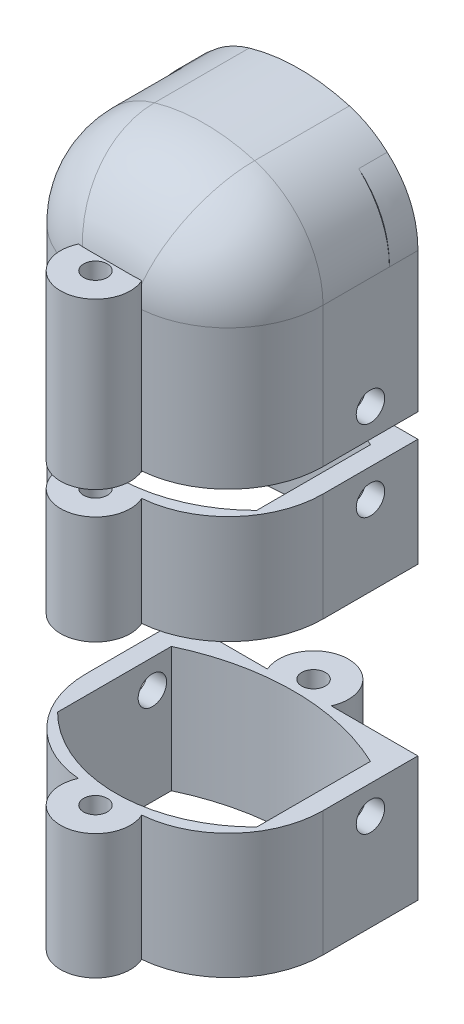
ISO-10303-21;
HEADER;
FILE_DESCRIPTION(('STEP AP214'),'2;1');
FILE_NAME('part.step','',(''),(''),'','','');
FILE_SCHEMA(('AUTOMOTIVE_DESIGN { 1 0 10303 214 1 1 1 1 }'));
ENDSEC;
DATA;
#1=APPLICATION_CONTEXT('core data for automotive mechanical design processes');
#2=APPLICATION_PROTOCOL_DEFINITION('international standard','automotive_design',2000,#1);
#3=PRODUCT_CONTEXT('',#1,'mechanical');
#4=PRODUCT('Part','Part','',(#3));
#5=PRODUCT_RELATED_PRODUCT_CATEGORY('part','',(#4));
#6=PRODUCT_DEFINITION_FORMATION('','',#4);
#7=PRODUCT_DEFINITION_CONTEXT('part definition',#1,'design');
#8=PRODUCT_DEFINITION('design','',#6,#7);
#9=PRODUCT_DEFINITION_SHAPE('','',#8);
#10=(LENGTH_UNIT() NAMED_UNIT(*) SI_UNIT(.MILLI.,.METRE.));
#11=(NAMED_UNIT(*) PLANE_ANGLE_UNIT() SI_UNIT($,.RADIAN.));
#12=(NAMED_UNIT(*) SI_UNIT($,.STERADIAN.) SOLID_ANGLE_UNIT());
#13=UNCERTAINTY_MEASURE_WITH_UNIT(LENGTH_MEASURE(1.E-05),#10,'distance_accuracy_value','');
#14=(GEOMETRIC_REPRESENTATION_CONTEXT(3) GLOBAL_UNCERTAINTY_ASSIGNED_CONTEXT((#13)) GLOBAL_UNIT_ASSIGNED_CONTEXT((#10,
#11,#12)) REPRESENTATION_CONTEXT('',''));
#15=CARTESIAN_POINT('',(0.,0.,0.));
#16=DIRECTION('',(0.,0.,1.));
#17=DIRECTION('',(1.,0.,0.));
#18=AXIS2_PLACEMENT_3D('',#15,#16,#17);
#19=CARTESIAN_POINT('',(-6.16812227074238,14.5,-1.5));
#20=DIRECTION('',(0.,-1.,0.));
#21=DIRECTION('',(0.,0.,-1.));
#22=AXIS2_PLACEMENT_3D('',#19,#20,#21);
#23=CYLINDRICAL_SURFACE('',#22,3.67977931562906);
#24=CARTESIAN_POINT('',(-6.16812227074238,-2.89296893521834,-1.5));
#25=DIRECTION('',(0.,1.,0.));
#26=DIRECTION('',(0.,0.,1.));
#27=AXIS2_PLACEMENT_3D('',#24,#25,#26);
#28=CIRCLE('',#27,3.67977931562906);
#29=CARTESIAN_POINT('',(-9.52829723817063,-2.89296893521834,0.));
#30=VERTEX_POINT('',#29);
#31=CARTESIAN_POINT('',(-2.80794730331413,-2.89296893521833,0.));
#32=VERTEX_POINT('',#31);
#33=EDGE_CURVE('E12',#30,#32,#28,.F.);
#34=ORIENTED_EDGE('',*,*,#33,.F.);
#35=DIRECTION('',(0.,-1.,0.));
#36=VECTOR('',#35,1.);
#37=CARTESIAN_POINT('',(-9.52829723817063,14.5,0.));
#38=LINE('',#37,#36);
#39=CARTESIAN_POINT('',(-9.52829723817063,14.5,0.));
#40=VERTEX_POINT('',#39);
#41=EDGE_CURVE('E297',#40,#30,#38,.T.);
#42=ORIENTED_EDGE('',*,*,#41,.F.);
#43=CARTESIAN_POINT('',(-6.16812227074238,14.5,-1.5));
#44=DIRECTION('',(0.,-1.,0.));
#45=DIRECTION('',(0.,0.,1.));
#46=AXIS2_PLACEMENT_3D('',#43,#44,#45);
#47=CIRCLE('',#46,3.67977931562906);
#48=CARTESIAN_POINT('',(-2.80794730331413,14.5,0.));
#49=VERTEX_POINT('',#48);
#50=EDGE_CURVE('E290',#40,#49,#47,.T.);
#51=ORIENTED_EDGE('',*,*,#50,.T.);
#52=DIRECTION('',(0.,-1.,0.));
#53=VECTOR('',#52,1.);
#54=CARTESIAN_POINT('',(-2.80794730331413,14.5,0.));
#55=LINE('',#54,#53);
#56=EDGE_CURVE('E293',#32,#49,#55,.F.);
#57=ORIENTED_EDGE('',*,*,#56,.F.);
#58=EDGE_LOOP('',(#34,#42,#51,#57));
#59=FACE_BOUND('',#58,.T.);
#60=ADVANCED_FACE('F52',(#59),#23,.T.);
#61=CARTESIAN_POINT('',(-6.16812227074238,14.5,21.5));
#62=DIRECTION('',(0.,-1.,0.));
#63=DIRECTION('',(0.,0.,-1.));
#64=AXIS2_PLACEMENT_3D('',#61,#62,#63);
#65=CYLINDRICAL_SURFACE('',#64,3.67977931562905);
#66=CARTESIAN_POINT('',(-6.16812227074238,-2.89296893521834,21.5));
#67=DIRECTION('',(0.,1.,0.));
#68=DIRECTION('',(0.,0.,1.));
#69=AXIS2_PLACEMENT_3D('',#66,#67,#68);
#70=CIRCLE('',#69,3.67977931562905);
#71=CARTESIAN_POINT('',(-2.8241042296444,-2.89296893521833,19.9643180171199));
#72=VERTEX_POINT('',#71);
#73=CARTESIAN_POINT('',(-9.51214031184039,-2.89296893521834,19.9643180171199));
#74=VERTEX_POINT('',#73);
#75=EDGE_CURVE('E62',#72,#74,#70,.F.);
#76=ORIENTED_EDGE('',*,*,#75,.F.);
#77=DIRECTION('',(0.,1.,0.));
#78=VECTOR('',#77,1.);
#79=CARTESIAN_POINT('',(-2.8241042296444,3.21949210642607,19.9643180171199));
#80=LINE('',#79,#78);
#81=CARTESIAN_POINT('',(-2.8241042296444,11.8429020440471,19.9643180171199));
#82=VERTEX_POINT('',#81);
#83=EDGE_CURVE('E273',#72,#82,#80,.T.);
#84=ORIENTED_EDGE('',*,*,#83,.T.);
#85=DIRECTION('',(0.,-1.,0.));
#86=VECTOR('',#85,1.);
#87=CARTESIAN_POINT('',(-2.82410422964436,14.5,19.9643180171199));
#88=LINE('',#87,#86);
#89=CARTESIAN_POINT('',(-2.82410422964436,14.5,19.9643180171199));
#90=VERTEX_POINT('',#89);
#91=EDGE_CURVE('E56',#90,#82,#88,.T.);
#92=ORIENTED_EDGE('',*,*,#91,.F.);
#93=CARTESIAN_POINT('',(-6.16812227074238,14.5,21.5));
#94=DIRECTION('',(0.,-1.,0.));
#95=DIRECTION('',(0.,0.,-1.));
#96=AXIS2_PLACEMENT_3D('',#93,#94,#95);
#97=CIRCLE('',#96,3.67977931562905);
#98=CARTESIAN_POINT('',(-9.51214031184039,14.5,19.9643180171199));
#99=VERTEX_POINT('',#98);
#100=EDGE_CURVE('E270',#90,#99,#97,.T.);
#101=ORIENTED_EDGE('',*,*,#100,.T.);
#102=DIRECTION('',(0.,-1.,0.));
#103=VECTOR('',#102,1.);
#104=CARTESIAN_POINT('',(-9.51214031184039,14.5,19.9643180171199));
#105=LINE('',#104,#103);
#106=CARTESIAN_POINT('',(-9.51214031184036,11.8429020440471,19.9643180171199));
#107=VERTEX_POINT('',#106);
#108=EDGE_CURVE('E272',#99,#107,#105,.T.);
#109=ORIENTED_EDGE('',*,*,#108,.T.);
#110=EDGE_CURVE('E275',#107,#74,#105,.T.);
#111=ORIENTED_EDGE('',*,*,#110,.T.);
#112=EDGE_LOOP('',(#76,#84,#92,#101,#109,#111));
#113=FACE_BOUND('',#112,.T.);
#114=ADVANCED_FACE('F54',(#113),#65,.T.);
#115=CARTESIAN_POINT('',(-6.16812227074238,15.5,-1.5));
#116=DIRECTION('',(0.,-1.,0.));
#117=DIRECTION('',(0.,0.,-1.));
#118=AXIS2_PLACEMENT_3D('',#115,#116,#117);
#119=CYLINDRICAL_SURFACE('',#118,1.25);
#120=CARTESIAN_POINT('',(-6.16812227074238,-2.89296893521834,-1.5));
#121=DIRECTION('',(0.,1.,0.));
#122=DIRECTION('',(0.,0.,1.));
#123=AXIS2_PLACEMENT_3D('',#120,#121,#122);
#124=CIRCLE('',#123,1.25);
#125=CARTESIAN_POINT('',(-6.16812227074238,-2.89296893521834,-0.249999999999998));
#126=VERTEX_POINT('',#125);
#127=EDGE_CURVE('E278',#126,#126,#124,.F.);
#128=ORIENTED_EDGE('',*,*,#127,.T.);
#129=EDGE_LOOP('',(#128));
#130=FACE_BOUND('',#129,.T.);
#131=CARTESIAN_POINT('',(-6.16812227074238,14.5,-1.5));
#132=DIRECTION('',(0.,1.,0.));
#133=DIRECTION('',(0.,0.,1.));
#134=AXIS2_PLACEMENT_3D('',#131,#132,#133);
#135=CIRCLE('',#134,1.25);
#136=CARTESIAN_POINT('',(-6.16812227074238,14.5,-0.249999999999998));
#137=VERTEX_POINT('',#136);
#138=EDGE_CURVE('E280',#137,#137,#135,.T.);
#139=ORIENTED_EDGE('',*,*,#138,.T.);
#140=EDGE_LOOP('',(#139));
#141=FACE_BOUND('',#140,.T.);
#142=ADVANCED_FACE('F445',(#130,#141),#119,.F.);
#143=CARTESIAN_POINT('',(-6.16812227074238,14.5,-1.5));
#144=DIRECTION('',(0.,1.,0.));
#145=DIRECTION('',(0.,0.,1.));
#146=AXIS2_PLACEMENT_3D('',#143,#144,#145);
#147=PLANE('',#146);
#148=DIRECTION('',(-1.,0.,0.));
#149=VECTOR('',#148,1.);
#150=CARTESIAN_POINT('',(-3.66812227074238,14.5,0.));
#151=LINE('',#150,#149);
#152=EDGE_CURVE('E289',#49,#40,#151,.T.);
#153=ORIENTED_EDGE('',*,*,#152,.F.);
#154=ORIENTED_EDGE('',*,*,#50,.F.);
#155=EDGE_LOOP('',(#153,#154));
#156=FACE_BOUND('',#155,.T.);
#157=ORIENTED_EDGE('',*,*,#138,.F.);
#158=EDGE_LOOP('',(#157));
#159=FACE_BOUND('',#158,.T.);
#160=ADVANCED_FACE('F449',(#156,#159),#147,.T.);
#161=CARTESIAN_POINT('',(-18.6681222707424,-2.89296893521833,-3.));
#162=DIRECTION('',(0.,1.,0.));
#163=DIRECTION('',(0.,0.,1.));
#164=AXIS2_PLACEMENT_3D('',#161,#162,#163);
#165=PLANE('',#164);
#166=DIRECTION('',(1.,0.,0.));
#167=VECTOR('',#166,1.);
#168=CARTESIAN_POINT('',(-6.16812227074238,-2.89296893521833,0.));
#169=LINE('',#168,#167);
#170=CARTESIAN_POINT('',(-18.6681222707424,-2.89296893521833,0.));
#171=VERTEX_POINT('',#170);
#172=EDGE_CURVE('E354',#171,#30,#169,.T.);
#173=ORIENTED_EDGE('',*,*,#172,.T.);
#174=ORIENTED_EDGE('',*,*,#33,.T.);
#175=CARTESIAN_POINT('',(6.33187772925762,-2.89296893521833,0.));
#176=VERTEX_POINT('',#175);
#177=EDGE_CURVE('E340',#32,#176,#169,.T.);
#178=ORIENTED_EDGE('',*,*,#177,.T.);
#179=DIRECTION('',(0.,0.,1.));
#180=VECTOR('',#179,1.);
#181=CARTESIAN_POINT('',(6.33187772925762,-2.89296893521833,-3.));
#182=LINE('',#181,#180);
#183=CARTESIAN_POINT('',(6.33187772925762,-2.89296893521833,10.));
#184=VERTEX_POINT('',#183);
#185=EDGE_CURVE('E337',#176,#184,#182,.T.);
#186=ORIENTED_EDGE('',*,*,#185,.T.);
#187=CARTESIAN_POINT('',(-3.66812227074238,-2.89296893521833,10.));
#188=DIRECTION('',(0.,1.,0.));
#189=DIRECTION('',(0.,0.,1.));
#190=AXIS2_PLACEMENT_3D('',#187,#188,#189);
#191=CIRCLE('',#190,10.);
#192=EDGE_CURVE('E285',#184,#72,#191,.F.);
#193=ORIENTED_EDGE('',*,*,#192,.T.);
#194=ORIENTED_EDGE('',*,*,#75,.T.);
#195=CARTESIAN_POINT('',(-8.66812227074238,-2.89296893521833,10.));
#196=DIRECTION('',(0.,1.,0.));
#197=DIRECTION('',(0.,0.,1.));
#198=AXIS2_PLACEMENT_3D('',#195,#196,#197);
#199=CIRCLE('',#198,10.);
#200=CARTESIAN_POINT('',(-18.6681222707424,-2.89296893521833,10.));
#201=VERTEX_POINT('',#200);
#202=EDGE_CURVE('E352',#74,#201,#199,.F.);
#203=ORIENTED_EDGE('',*,*,#202,.T.);
#204=DIRECTION('',(0.,0.,1.));
#205=VECTOR('',#204,1.);
#206=CARTESIAN_POINT('',(-18.6681222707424,-2.89296893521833,-3.));
#207=LINE('',#206,#205);
#208=EDGE_CURVE('E316',#171,#201,#207,.T.);
#209=ORIENTED_EDGE('',*,*,#208,.F.);
#210=EDGE_LOOP('',(#173,#174,#178,#186,#193,#194,#203,#209));
#211=FACE_BOUND('',#210,.T.);
#212=ORIENTED_EDGE('',*,*,#127,.F.);
#213=EDGE_LOOP('',(#212));
#214=FACE_BOUND('',#213,.T.);
#215=DIRECTION('',(0.,0.,1.));
#216=VECTOR('',#215,1.);
#217=CARTESIAN_POINT('',(4.33187772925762,-2.89296893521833,15.));
#218=LINE('',#217,#216);
#219=CARTESIAN_POINT('',(4.33187772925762,-2.89296893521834,3.));
#220=VERTEX_POINT('',#219);
#221=CARTESIAN_POINT('',(4.33187772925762,-2.89296893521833,15.));
#222=VERTEX_POINT('',#221);
#223=EDGE_CURVE('E330',#220,#222,#218,.T.);
#224=ORIENTED_EDGE('',*,*,#223,.F.);
#225=CARTESIAN_POINT('',(-6.16812227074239,-2.89296893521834,25.0369131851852));
#226=DIRECTION('',(0.,1.,0.));
#227=DIRECTION('',(0.,0.,1.));
#228=AXIS2_PLACEMENT_3D('',#225,#226,#227);
#229=CIRCLE('',#228,24.4105621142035);
#230=CARTESIAN_POINT('',(-16.6681222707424,-2.89296893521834,3.));
#231=VERTEX_POINT('',#230);
#232=EDGE_CURVE('E370',#231,#220,#229,.F.);
#233=ORIENTED_EDGE('',*,*,#232,.F.);
#234=DIRECTION('',(0.,0.,-1.));
#235=VECTOR('',#234,1.);
#236=CARTESIAN_POINT('',(-16.6681222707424,-2.89296893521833,15.));
#237=LINE('',#236,#235);
#238=CARTESIAN_POINT('',(-16.6681222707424,-2.89296893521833,15.));
#239=VERTEX_POINT('',#238);
#240=EDGE_CURVE('E334',#239,#231,#237,.T.);
#241=ORIENTED_EDGE('',*,*,#240,.F.);
#242=CARTESIAN_POINT('',(-6.16812227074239,-2.89296893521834,4.50000000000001));
#243=DIRECTION('',(0.,1.,0.));
#244=DIRECTION('',(0.,0.,1.));
#245=AXIS2_PLACEMENT_3D('',#242,#243,#244);
#246=CIRCLE('',#245,14.8492424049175);
#247=EDGE_CURVE('E322',#222,#239,#246,.F.);
#248=ORIENTED_EDGE('',*,*,#247,.F.);
#249=EDGE_LOOP('',(#224,#233,#241,#248));
#250=FACE_BOUND('',#249,.T.);
#251=CARTESIAN_POINT('',(-6.16812227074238,-2.89296893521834,21.5));
#252=DIRECTION('',(0.,1.,0.));
#253=DIRECTION('',(0.,0.,1.));
#254=AXIS2_PLACEMENT_3D('',#251,#252,#253);
#255=CIRCLE('',#254,1.25);
#256=CARTESIAN_POINT('',(-6.16812227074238,-2.89296893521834,22.75));
#257=VERTEX_POINT('',#256);
#258=EDGE_CURVE('E347',#257,#257,#255,.F.);
#259=ORIENTED_EDGE('',*,*,#258,.F.);
#260=EDGE_LOOP('',(#259));
#261=FACE_BOUND('',#260,.T.);
#262=ADVANCED_FACE('F463',(#211,#214,#250,#261),#165,.F.);
#263=CARTESIAN_POINT('',(-16.6681222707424,12.5,15.));
#264=DIRECTION('',(-1.,0.,0.));
#265=DIRECTION('',(0.,-1.,0.));
#266=AXIS2_PLACEMENT_3D('',#263,#264,#265);
#267=PLANE('',#266);
#268=CARTESIAN_POINT('',(-16.6681222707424,0.107031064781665,5.));
#269=DIRECTION('',(-1.,0.,0.));
#270=DIRECTION('',(0.,-1.,0.));
#271=AXIS2_PLACEMENT_3D('',#268,#269,#270);
#272=CIRCLE('',#271,1.5);
#273=CARTESIAN_POINT('',(-16.6681222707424,-1.39296893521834,5.));
#274=VERTEX_POINT('',#273);
#275=EDGE_CURVE('E339',#274,#274,#272,.T.);
#276=ORIENTED_EDGE('',*,*,#275,.T.);
#277=EDGE_LOOP('',(#276));
#278=FACE_BOUND('',#277,.T.);
#279=DIRECTION('',(0.,1.,0.));
#280=VECTOR('',#279,1.);
#281=CARTESIAN_POINT('',(-16.6681222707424,12.5,15.));
#282=LINE('',#281,#280);
#283=CARTESIAN_POINT('',(-16.6681222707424,12.5,15.));
#284=VERTEX_POINT('',#283);
#285=EDGE_CURVE('E319',#239,#284,#282,.T.);
#286=ORIENTED_EDGE('',*,*,#285,.F.);
#287=ORIENTED_EDGE('',*,*,#240,.T.);
#288=DIRECTION('',(0.,1.,0.));
#289=VECTOR('',#288,1.);
#290=CARTESIAN_POINT('',(-16.6681222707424,12.5,3.));
#291=LINE('',#290,#289);
#292=CARTESIAN_POINT('',(-16.6681222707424,12.5,3.));
#293=VERTEX_POINT('',#292);
#294=EDGE_CURVE('E332',#231,#293,#291,.T.);
#295=ORIENTED_EDGE('',*,*,#294,.T.);
#296=DIRECTION('',(0.,0.,-1.));
#297=VECTOR('',#296,1.);
#298=CARTESIAN_POINT('',(-16.6681222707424,12.5,15.));
#299=LINE('',#298,#297);
#300=EDGE_CURVE('E499',#284,#293,#299,.T.);
#301=ORIENTED_EDGE('',*,*,#300,.F.);
#302=EDGE_LOOP('',(#286,#287,#295,#301));
#303=FACE_BOUND('',#302,.T.);
#304=ADVANCED_FACE('F605',(#278,#303),#267,.F.);
#305=CARTESIAN_POINT('',(4.33187772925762,12.5,15.));
#306=DIRECTION('',(1.,0.,0.));
#307=DIRECTION('',(0.,1.,0.));
#308=AXIS2_PLACEMENT_3D('',#305,#306,#307);
#309=PLANE('',#308);
#310=CARTESIAN_POINT('',(4.33187772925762,0.107031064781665,5.));
#311=DIRECTION('',(1.,0.,0.));
#312=DIRECTION('',(0.,1.,0.));
#313=AXIS2_PLACEMENT_3D('',#310,#311,#312);
#314=CIRCLE('',#313,1.5);
#315=CARTESIAN_POINT('',(4.33187772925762,1.60703106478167,5.));
#316=VERTEX_POINT('',#315);
#317=EDGE_CURVE('E331',#316,#316,#314,.T.);
#318=ORIENTED_EDGE('',*,*,#317,.T.);
#319=EDGE_LOOP('',(#318));
#320=FACE_BOUND('',#319,.T.);
#321=DIRECTION('',(0.,-1.,0.));
#322=VECTOR('',#321,1.);
#323=CARTESIAN_POINT('',(4.33187772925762,12.5,3.));
#324=LINE('',#323,#322);
#325=CARTESIAN_POINT('',(4.33187772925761,12.5,3.));
#326=VERTEX_POINT('',#325);
#327=EDGE_CURVE('E327',#326,#220,#324,.T.);
#328=ORIENTED_EDGE('',*,*,#327,.T.);
#329=ORIENTED_EDGE('',*,*,#223,.T.);
#330=DIRECTION('',(0.,-1.,0.));
#331=VECTOR('',#330,1.);
#332=CARTESIAN_POINT('',(4.33187772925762,12.5,15.));
#333=LINE('',#332,#331);
#334=CARTESIAN_POINT('',(4.33187772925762,12.5,15.));
#335=VERTEX_POINT('',#334);
#336=EDGE_CURVE('E323',#335,#222,#333,.T.);
#337=ORIENTED_EDGE('',*,*,#336,.F.);
#338=DIRECTION('',(0.,0.,-1.));
#339=VECTOR('',#338,1.);
#340=CARTESIAN_POINT('',(4.33187772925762,12.5,15.));
#341=LINE('',#340,#339);
#342=EDGE_CURVE('E326',#335,#326,#341,.T.);
#343=ORIENTED_EDGE('',*,*,#342,.T.);
#344=EDGE_LOOP('',(#328,#329,#337,#343));
#345=FACE_BOUND('',#344,.T.);
#346=ADVANCED_FACE('F572',(#320,#345),#309,.F.);
#347=CARTESIAN_POINT('',(-6.16812227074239,13.5,4.50000000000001));
#348=DIRECTION('',(0.,-1.,0.));
#349=DIRECTION('',(0.,0.,-1.));
#350=AXIS2_PLACEMENT_3D('',#347,#348,#349);
#351=CYLINDRICAL_SURFACE('',#350,14.8492424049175);
#352=ORIENTED_EDGE('',*,*,#336,.T.);
#353=ORIENTED_EDGE('',*,*,#247,.T.);
#354=ORIENTED_EDGE('',*,*,#285,.T.);
#355=DIRECTION('',(0.,-1.,0.));
#356=VECTOR('',#355,1.);
#357=CARTESIAN_POINT('',(-16.6681222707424,13.5,15.));
#358=LINE('',#357,#356);
#359=CARTESIAN_POINT('',(-16.6681222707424,13.5,15.));
#360=VERTEX_POINT('',#359);
#361=EDGE_CURVE('E582',#360,#284,#358,.T.);
#362=ORIENTED_EDGE('',*,*,#361,.F.);
#363=CARTESIAN_POINT('',(-6.16812227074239,13.5,4.50000000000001));
#364=DIRECTION('',(0.,-1.,0.));
#365=DIRECTION('',(0.,0.,1.));
#366=AXIS2_PLACEMENT_3D('',#363,#364,#365);
#367=CIRCLE('',#366,14.8492424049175);
#368=CARTESIAN_POINT('',(4.33187772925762,13.5,15.));
#369=VERTEX_POINT('',#368);
#370=EDGE_CURVE('E592',#369,#360,#367,.T.);
#371=ORIENTED_EDGE('',*,*,#370,.F.);
#372=DIRECTION('',(0.,-1.,0.));
#373=VECTOR('',#372,1.);
#374=CARTESIAN_POINT('',(4.33187772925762,13.5,15.));
#375=LINE('',#374,#373);
#376=EDGE_CURVE('E321',#369,#335,#375,.T.);
#377=ORIENTED_EDGE('',*,*,#376,.T.);
#378=EDGE_LOOP('',(#352,#353,#354,#362,#371,#377));
#379=FACE_BOUND('',#378,.T.);
#380=ADVANCED_FACE('F690',(#379),#351,.F.);
#381=CARTESIAN_POINT('',(-6.16812227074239,15.5,25.0369131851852));
#382=DIRECTION('',(0.,-1.,0.));
#383=DIRECTION('',(0.,0.,-1.));
#384=AXIS2_PLACEMENT_3D('',#381,#382,#383);
#385=CYLINDRICAL_SURFACE('',#384,24.4105621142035);
#386=ORIENTED_EDGE('',*,*,#294,.F.);
#387=ORIENTED_EDGE('',*,*,#232,.T.);
#388=ORIENTED_EDGE('',*,*,#327,.F.);
#389=DIRECTION('',(0.,-1.,0.));
#390=VECTOR('',#389,1.);
#391=CARTESIAN_POINT('',(4.33187772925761,15.5,3.));
#392=LINE('',#391,#390);
#393=CARTESIAN_POINT('',(4.33187772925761,15.5,3.));
#394=VERTEX_POINT('',#393);
#395=EDGE_CURVE('E363',#394,#326,#392,.T.);
#396=ORIENTED_EDGE('',*,*,#395,.F.);
#397=CARTESIAN_POINT('',(-6.16812227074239,15.5,25.0369131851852));
#398=DIRECTION('',(0.,-1.,0.));
#399=DIRECTION('',(0.,0.,-1.));
#400=AXIS2_PLACEMENT_3D('',#397,#398,#399);
#401=CIRCLE('',#400,24.4105621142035);
#402=CARTESIAN_POINT('',(-16.6681222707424,15.5,3.));
#403=VERTEX_POINT('',#402);
#404=EDGE_CURVE('E359',#403,#394,#401,.T.);
#405=ORIENTED_EDGE('',*,*,#404,.F.);
#406=DIRECTION('',(0.,-1.,0.));
#407=VECTOR('',#406,1.);
#408=CARTESIAN_POINT('',(-16.6681222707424,15.5,3.));
#409=LINE('',#408,#407);
#410=EDGE_CURVE('E366',#403,#293,#409,.T.);
#411=ORIENTED_EDGE('',*,*,#410,.T.);
#412=EDGE_LOOP('',(#386,#387,#388,#396,#405,#411));
#413=FACE_BOUND('',#412,.T.);
#414=ADVANCED_FACE('F683',(#413),#385,.F.);
#415=CARTESIAN_POINT('',(-14.7297800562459,19.718593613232,3.));
#416=DIRECTION('',(0.,0.,1.));
#417=DIRECTION('',(1.,0.,0.));
#418=AXIS2_PLACEMENT_3D('',#415,#416,#417);
#419=PLANE('',#418);
#420=CARTESIAN_POINT('',(-6.16812227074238,9.2893444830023,3.));
#421=DIRECTION('',(0.,0.,1.));
#422=DIRECTION('',(1.,0.,0.));
#423=AXIS2_PLACEMENT_3D('',#420,#421,#422);
#424=CIRCLE('',#423,10.9799047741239);
#425=CARTESIAN_POINT('',(-15.2227380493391,15.5,3.));
#426=VERTEX_POINT('',#425);
#427=CARTESIAN_POINT('',(2.88649350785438,15.5,3.));
#428=VERTEX_POINT('',#427);
#429=EDGE_CURVE('E498',#426,#428,#424,.F.);
#430=ORIENTED_EDGE('',*,*,#429,.F.);
#431=DIRECTION('',(1.,0.,0.));
#432=VECTOR('',#431,1.);
#433=CARTESIAN_POINT('',(-14.7297800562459,15.5,3.));
#434=LINE('',#433,#432);
#435=EDGE_CURVE('E369',#426,#428,#434,.T.);
#436=ORIENTED_EDGE('',*,*,#435,.T.);
#437=EDGE_LOOP('',(#430,#436));
#438=FACE_BOUND('',#437,.T.);
#439=ADVANCED_FACE('F669',(#438),#419,.T.);
#440=CARTESIAN_POINT('',(-6.16812227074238,9.2893444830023,15.));
#441=DIRECTION('',(0.,0.,1.));
#442=DIRECTION('',(1.,0.,0.));
#443=AXIS2_PLACEMENT_3D('',#440,#441,#442);
#444=PLANE('',#443);
#445=CARTESIAN_POINT('',(-6.16812227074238,9.2893444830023,15.));
#446=DIRECTION('',(0.,0.,-1.));
#447=DIRECTION('',(1.,0.,0.));
#448=AXIS2_PLACEMENT_3D('',#445,#446,#447);
#449=CIRCLE('',#448,10.9799047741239);
#450=CARTESIAN_POINT('',(-16.3085704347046,13.5,15.));
#451=VERTEX_POINT('',#450);
#452=CARTESIAN_POINT('',(3.97232589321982,13.5,15.));
#453=VERTEX_POINT('',#452);
#454=EDGE_CURVE('E401',#451,#453,#449,.T.);
#455=ORIENTED_EDGE('',*,*,#454,.T.);
#456=DIRECTION('',(-1.,0.,0.));
#457=VECTOR('',#456,1.);
#458=CARTESIAN_POINT('',(-6.16812227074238,13.5,15.));
#459=LINE('',#458,#457);
#460=CARTESIAN_POINT('',(3.43480349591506,13.5,15.));
#461=VERTEX_POINT('',#460);
#462=EDGE_CURVE('E415',#453,#461,#459,.T.);
#463=ORIENTED_EDGE('',*,*,#462,.T.);
#464=DIRECTION('',(0.,1.,0.));
#465=VECTOR('',#464,1.);
#466=CARTESIAN_POINT('',(3.43480349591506,-1.49999999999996,15.));
#467=LINE('',#466,#465);
#468=CARTESIAN_POINT('',(3.43480349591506,-1.49999999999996,15.));
#469=VERTEX_POINT('',#468);
#470=EDGE_CURVE('E350',#469,#461,#467,.T.);
#471=ORIENTED_EDGE('',*,*,#470,.F.);
#472=DIRECTION('',(1.,0.,0.));
#473=VECTOR('',#472,1.);
#474=CARTESIAN_POINT('',(-15.0227681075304,-1.49999999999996,15.));
#475=LINE('',#474,#473);
#476=CARTESIAN_POINT('',(-15.0227681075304,-1.49999999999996,15.));
#477=VERTEX_POINT('',#476);
#478=EDGE_CURVE('E253',#477,#469,#475,.T.);
#479=ORIENTED_EDGE('',*,*,#478,.F.);
#480=DIRECTION('',(0.,1.,0.));
#481=VECTOR('',#480,1.);
#482=CARTESIAN_POINT('',(-15.0227681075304,-1.49999999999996,15.));
#483=LINE('',#482,#481);
#484=CARTESIAN_POINT('',(-15.0227681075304,13.5,15.));
#485=VERTEX_POINT('',#484);
#486=EDGE_CURVE('E411',#477,#485,#483,.T.);
#487=ORIENTED_EDGE('',*,*,#486,.T.);
#488=EDGE_CURVE('E414',#485,#451,#459,.T.);
#489=ORIENTED_EDGE('',*,*,#488,.T.);
#490=EDGE_LOOP('',(#455,#463,#471,#479,#487,#489));
#491=FACE_BOUND('',#490,.T.);
#492=ADVANCED_FACE('F608',(#491),#444,.F.);
#493=CARTESIAN_POINT('',(-6.16812227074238,9.2893444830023,15.));
#494=DIRECTION('',(0.,0.,-1.));
#495=DIRECTION('',(-1.,0.,0.));
#496=AXIS2_PLACEMENT_3D('',#493,#494,#495);
#497=CYLINDRICAL_SURFACE('',#496,10.9799047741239);
#498=ORIENTED_EDGE('',*,*,#300,.T.);
#499=EDGE_CURVE('E492',#293,#426,#424,.F.);
#500=ORIENTED_EDGE('',*,*,#499,.T.);
#501=ORIENTED_EDGE('',*,*,#429,.T.);
#502=EDGE_CURVE('E500',#428,#326,#424,.F.);
#503=ORIENTED_EDGE('',*,*,#502,.T.);
#504=ORIENTED_EDGE('',*,*,#342,.F.);
#505=EDGE_CURVE('E560',#453,#335,#449,.T.);
#506=ORIENTED_EDGE('',*,*,#505,.F.);
#507=ORIENTED_EDGE('',*,*,#454,.F.);
#508=EDGE_CURVE('E559',#284,#451,#449,.T.);
#509=ORIENTED_EDGE('',*,*,#508,.F.);
#510=EDGE_LOOP('',(#498,#500,#501,#503,#504,#506,#507,#509));
#511=FACE_BOUND('',#510,.T.);
#512=ADVANCED_FACE('F575',(#511),#497,.F.);
#513=CARTESIAN_POINT('',(-16.6681222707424,13.5,15.));
#514=DIRECTION('',(0.,0.,-1.));
#515=DIRECTION('',(-1.,0.,0.));
#516=AXIS2_PLACEMENT_3D('',#513,#514,#515);
#517=PLANE('',#516);
#518=ORIENTED_EDGE('',*,*,#376,.F.);
#519=DIRECTION('',(1.,0.,0.));
#520=VECTOR('',#519,1.);
#521=CARTESIAN_POINT('',(-16.6681222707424,13.5,15.));
#522=LINE('',#521,#520);
#523=EDGE_CURVE('E589',#453,#369,#522,.T.);
#524=ORIENTED_EDGE('',*,*,#523,.F.);
#525=ORIENTED_EDGE('',*,*,#505,.T.);
#526=EDGE_LOOP('',(#518,#524,#525));
#527=FACE_BOUND('',#526,.T.);
#528=ADVANCED_FACE('F609',(#527),#517,.F.);
#529=EDGE_CURVE('E373',#360,#451,#522,.T.);
#530=ORIENTED_EDGE('',*,*,#529,.F.);
#531=ORIENTED_EDGE('',*,*,#361,.T.);
#532=ORIENTED_EDGE('',*,*,#508,.T.);
#533=EDGE_LOOP('',(#530,#531,#532));
#534=FACE_BOUND('',#533,.T.);
#535=ADVANCED_FACE('F601',(#534),#517,.F.);
#536=CARTESIAN_POINT('',(-6.16812227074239,13.5,4.50000000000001));
#537=DIRECTION('',(0.,1.,0.));
#538=DIRECTION('',(0.,0.,1.));
#539=AXIS2_PLACEMENT_3D('',#536,#537,#538);
#540=PLANE('',#539);
#541=ORIENTED_EDGE('',*,*,#488,.F.);
#542=CARTESIAN_POINT('',(-5.79398230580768,13.5,5.77121419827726));
#543=DIRECTION('',(0.,-1.,0.));
#544=DIRECTION('',(0.,0.,1.));
#545=AXIS2_PLACEMENT_3D('',#542,#543,#544);
#546=CIRCLE('',#545,13.0514740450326);
#547=EDGE_CURVE('E417',#461,#485,#546,.T.);
#548=ORIENTED_EDGE('',*,*,#547,.F.);
#549=ORIENTED_EDGE('',*,*,#462,.F.);
#550=ORIENTED_EDGE('',*,*,#523,.T.);
#551=ORIENTED_EDGE('',*,*,#370,.T.);
#552=ORIENTED_EDGE('',*,*,#529,.T.);
#553=EDGE_LOOP('',(#541,#548,#549,#550,#551,#552));
#554=FACE_BOUND('',#553,.T.);
#555=ADVANCED_FACE('F598',(#554),#540,.F.);
#556=CARTESIAN_POINT('',(-16.6681222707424,15.5,3.));
#557=DIRECTION('',(0.,0.,1.));
#558=DIRECTION('',(1.,0.,0.));
#559=AXIS2_PLACEMENT_3D('',#556,#557,#558);
#560=PLANE('',#559);
#561=ORIENTED_EDGE('',*,*,#410,.F.);
#562=DIRECTION('',(-1.,0.,0.));
#563=VECTOR('',#562,1.);
#564=CARTESIAN_POINT('',(-16.6681222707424,15.5,3.));
#565=LINE('',#564,#563);
#566=EDGE_CURVE('E365',#426,#403,#565,.T.);
#567=ORIENTED_EDGE('',*,*,#566,.F.);
#568=ORIENTED_EDGE('',*,*,#499,.F.);
#569=EDGE_LOOP('',(#561,#567,#568));
#570=FACE_BOUND('',#569,.T.);
#571=ADVANCED_FACE('F663',(#570),#560,.F.);
#572=EDGE_CURVE('E362',#394,#428,#565,.T.);
#573=ORIENTED_EDGE('',*,*,#572,.F.);
#574=ORIENTED_EDGE('',*,*,#395,.T.);
#575=ORIENTED_EDGE('',*,*,#502,.F.);
#576=EDGE_LOOP('',(#573,#574,#575));
#577=FACE_BOUND('',#576,.T.);
#578=ADVANCED_FACE('F661',(#577),#560,.F.);
#579=CARTESIAN_POINT('',(-6.16812227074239,15.5,25.0369131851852));
#580=DIRECTION('',(0.,-1.,0.));
#581=DIRECTION('',(0.,0.,-1.));
#582=AXIS2_PLACEMENT_3D('',#579,#580,#581);
#583=PLANE('',#582);
#584=ORIENTED_EDGE('',*,*,#404,.T.);
#585=ORIENTED_EDGE('',*,*,#572,.T.);
#586=ORIENTED_EDGE('',*,*,#435,.F.);
#587=ORIENTED_EDGE('',*,*,#566,.T.);
#588=EDGE_LOOP('',(#584,#585,#586,#587));
#589=FACE_BOUND('',#588,.T.);
#590=ADVANCED_FACE('F657',(#589),#583,.T.);
#591=CARTESIAN_POINT('',(-4.66668014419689,22.1090681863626,3.));
#592=CARTESIAN_POINT('',(1.08271353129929,21.8105341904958,3.));
#593=CARTESIAN_POINT('',(6.37837146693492,18.298642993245,3.));
#594=CARTESIAN_POINT('',(6.33187772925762,11.8429020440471,3.));
#595=B_SPLINE_CURVE_WITH_KNOTS('',3,(#591,#592,#593,#594),.UNSPECIFIED.,.F.,.F.,(4,4),(0.,
0.484713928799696),.UNSPECIFIED.);
#596=CARTESIAN_POINT('',(3.09906398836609,19.2053194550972,3.));
#597=VERTEX_POINT('',#596);
#598=CARTESIAN_POINT('',(6.33187772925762,11.8429020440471,3.));
#599=VERTEX_POINT('',#598);
#600=EDGE_CURVE('E507',#597,#599,#595,.T.);
#601=ORIENTED_EDGE('',*,*,#600,.F.);
#602=CARTESIAN_POINT('',(-3.66812227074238,11.8429020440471,3.));
#603=DIRECTION('',(0.,0.,1.));
#604=DIRECTION('',(1.,0.,0.));
#605=AXIS2_PLACEMENT_3D('',#602,#603,#604);
#606=CIRCLE('',#605,10.);
#607=EDGE_CURVE('E506',#597,#599,#606,.F.);
#608=ORIENTED_EDGE('',*,*,#607,.T.);
#609=EDGE_LOOP('',(#601,#608));
#610=FACE_BOUND('',#609,.T.);
#611=ADVANCED_FACE('F660',(#610),#419,.T.);
#612=CARTESIAN_POINT('',(-18.6681222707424,11.8429020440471,3.));
#613=CARTESIAN_POINT('',(-19.0348657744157,19.2719032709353,3.));
#614=CARTESIAN_POINT('',(-11.9657995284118,21.9640532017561,3.));
#615=CARTESIAN_POINT('',(-6.16812227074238,22.1979774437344,3.));
#616=B_SPLINE_CURVE_WITH_KNOTS('',3,(#612,#613,#614,#615),.UNSPECIFIED.,.F.,.F.,(4,4),(0.,1.),.UNSPECIFIED.);
#617=CARTESIAN_POINT('',(-18.6681222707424,11.8429020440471,3.));
#618=VERTEX_POINT('',#617);
#619=CARTESIAN_POINT('',(-15.4353085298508,19.2053194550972,3.));
#620=VERTEX_POINT('',#619);
#621=EDGE_CURVE('E391',#618,#620,#616,.T.);
#622=ORIENTED_EDGE('',*,*,#621,.F.);
#623=CARTESIAN_POINT('',(-8.66812227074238,11.8429020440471,3.));
#624=DIRECTION('',(0.,0.,1.));
#625=DIRECTION('',(1.,0.,0.));
#626=AXIS2_PLACEMENT_3D('',#623,#624,#625);
#627=CIRCLE('',#626,10.);
#628=EDGE_CURVE('E248',#618,#620,#627,.F.);
#629=ORIENTED_EDGE('',*,*,#628,.T.);
#630=EDGE_LOOP('',(#622,#629));
#631=FACE_BOUND('',#630,.T.);
#632=ADVANCED_FACE('F641',(#631),#419,.T.);
#633=CARTESIAN_POINT('',(-6.16812227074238,3.21949210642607,10.));
#634=DIRECTION('',(0.,0.,-1.));
#635=DIRECTION('',(-1.,0.,0.));
#636=AXIS2_PLACEMENT_3D('',#633,#634,#635);
#637=DEGENERATE_TOROIDAL_SURFACE('',#636,8.97848533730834,10.,.T.);
#638=CARTESIAN_POINT('',(-2.8239042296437,12.4552778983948,19.9643095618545));
#639=CARTESIAN_POINT('',(-2.87496656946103,12.4466192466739,19.9664682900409));
#640=CARTESIAN_POINT('',(-2.92585341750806,12.4365127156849,19.9686195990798));
#641=CARTESIAN_POINT('',(-3.02791986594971,12.4123457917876,19.9729345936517));
#642=CARTESIAN_POINT('',(-3.07907880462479,12.3981990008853,19.9750974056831));
#643=CARTESIAN_POINT('',(-3.19465128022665,12.3603986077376,19.9799833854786));
#644=CARTESIAN_POINT('',(-3.2585666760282,12.3351747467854,19.9826854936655));
#645=CARTESIAN_POINT('',(-3.38067897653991,12.2738627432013,19.9878479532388));
#646=CARTESIAN_POINT('',(-3.43893401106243,12.23790509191,19.9903107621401));
#647=CARTESIAN_POINT('',(-3.51100613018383,12.1772840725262,19.9933577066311));
#648=CARTESIAN_POINT('',(-3.53023125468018,12.1591384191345,19.9941704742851));
#649=CARTESIAN_POINT('',(-3.56592006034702,12.1202832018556,19.9956792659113));
#650=CARTESIAN_POINT('',(-3.58238603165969,12.0995757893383,19.9963753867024));
#651=CARTESIAN_POINT('',(-3.61175405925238,12.0553868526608,19.9976169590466));
#652=CARTESIAN_POINT('',(-3.62461408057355,12.0318768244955,19.9981606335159));
#653=CARTESIAN_POINT('',(-3.64554834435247,11.9827872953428,19.9990456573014));
#654=CARTESIAN_POINT('',(-3.65362546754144,11.9572090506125,19.9993871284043));
#655=CARTESIAN_POINT('',(-3.66217875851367,11.9165871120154,19.9997487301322));
#656=CARTESIAN_POINT('',(-3.66443693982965,11.901894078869,19.9998441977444));
#657=CARTESIAN_POINT('',(-3.6674142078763,11.8723675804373,19.9999700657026));
#658=CARTESIAN_POINT('',(-3.66813499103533,11.8575342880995,20.0000005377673));
#659=CARTESIAN_POINT('',(-3.66812222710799,11.8427020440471,19.9999999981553));
#660=B_SPLINE_CURVE_WITH_KNOTS('',3,(#638,#639,#640,#641,#642,#643,#644,#645,#646,#647,#648,
#649,#650,#651,#652,#653,#654,#655,#656,#657,#658,#659),.UNSPECIFIED.,.F.,.F.,(4,2,2,2,2,2,2,2,
2,2,4),(0.,0.155593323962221,0.314801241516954,0.520559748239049,0.723912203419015,
0.803048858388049,0.882119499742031,0.962076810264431,1.04198591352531,1.08651003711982,
1.13098500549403),.UNSPECIFIED.);
#661=CARTESIAN_POINT('',(-3.60257706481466,12.0689913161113,19.9972289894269));
#662=VERTEX_POINT('',#661);
#663=CARTESIAN_POINT('',(-3.66812227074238,11.8429020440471,20.));
#664=VERTEX_POINT('',#663);
#665=EDGE_CURVE('E226',#662,#664,#660,.T.);
#666=ORIENTED_EDGE('',*,*,#665,.F.);
#667=CARTESIAN_POINT('',(-3.66812227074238,11.8429020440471,10.));
#668=DIRECTION('',(-0.960452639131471,0.278443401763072,0.));
#669=DIRECTION('',(-0.278443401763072,-0.960452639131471,0.));
#670=AXIS2_PLACEMENT_3D('',#667,#668,#669);
#671=CIRCLE('',#670,10.);
#672=CARTESIAN_POINT('',(-0.883688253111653,21.4474284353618,10.));
#673=VERTEX_POINT('',#672);
#674=EDGE_CURVE('E230',#662,#673,#671,.T.);
#675=ORIENTED_EDGE('',*,*,#674,.T.);
#676=CARTESIAN_POINT('',(-6.16812227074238,3.21949210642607,10.));
#677=DIRECTION('',(0.,0.,-1.));
#678=DIRECTION('',(-1.,0.,0.));
#679=AXIS2_PLACEMENT_3D('',#676,#677,#678);
#680=CIRCLE('',#679,18.9784853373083);
#681=CARTESIAN_POINT('',(-11.4525562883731,21.4474284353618,10.));
#682=VERTEX_POINT('',#681);
#683=EDGE_CURVE('E532',#682,#673,#680,.T.);
#684=ORIENTED_EDGE('',*,*,#683,.F.);
#685=CARTESIAN_POINT('',(-8.66812227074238,11.8429020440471,10.));
#686=DIRECTION('',(-0.960452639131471,-0.278443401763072,0.));
#687=DIRECTION('',(0.278443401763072,-0.960452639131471,0.));
#688=AXIS2_PLACEMENT_3D('',#685,#686,#687);
#689=CIRCLE('',#688,10.);
#690=CARTESIAN_POINT('',(-8.73366747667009,12.0689913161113,19.9972289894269));
#691=VERTEX_POINT('',#690);
#692=EDGE_CURVE('E550',#691,#682,#689,.T.);
#693=ORIENTED_EDGE('',*,*,#692,.F.);
#694=CARTESIAN_POINT('',(-8.66812231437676,11.8427020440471,19.9999999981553));
#695=CARTESIAN_POINT('',(-8.66803025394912,11.8663106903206,20.0000038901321));
#696=CARTESIAN_POINT('',(-8.66991839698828,11.8899487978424,19.9999240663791));
#697=CARTESIAN_POINT('',(-8.67761802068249,11.9364338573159,19.9995985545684));
#698=CARTESIAN_POINT('',(-8.68340702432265,11.9592845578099,19.9993538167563));
#699=CARTESIAN_POINT('',(-8.69888840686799,12.0036815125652,19.998699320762));
#700=CARTESIAN_POINT('',(-8.70858968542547,12.0252246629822,19.9982891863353));
#701=CARTESIAN_POINT('',(-8.73133190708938,12.0664509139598,19.9973277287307));
#702=CARTESIAN_POINT('',(-8.74437525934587,12.0861326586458,19.9967763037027));
#703=CARTESIAN_POINT('',(-8.77907393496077,12.1312065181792,19.9953093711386));
#704=CARTESIAN_POINT('',(-8.80205498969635,12.1555699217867,19.9943378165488));
#705=CARTESIAN_POINT('',(-8.85152928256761,12.2004373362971,19.9922462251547));
#706=CARTESIAN_POINT('',(-8.87803391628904,12.2209282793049,19.9911257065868));
#707=CARTESIAN_POINT('',(-8.95437273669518,12.2729831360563,19.9878983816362));
#708=CARTESIAN_POINT('',(-9.00655940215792,12.3010455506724,19.9856921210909));
#709=CARTESIAN_POINT('',(-9.11431285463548,12.3497019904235,19.9811367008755));
#710=CARTESIAN_POINT('',(-9.1698919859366,12.37026657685,19.9787870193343));
#711=CARTESIAN_POINT('',(-9.27336139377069,12.402752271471,19.9744127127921));
#712=CARTESIAN_POINT('',(-9.32098681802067,12.4155431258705,19.9723992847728));
#713=CARTESIAN_POINT('',(-9.41647167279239,12.4377187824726,19.9683625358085));
#714=CARTESIAN_POINT('',(-9.46432258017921,12.4471399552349,19.9663395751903));
#715=CARTESIAN_POINT('',(-9.51234031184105,12.4552778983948,19.9643095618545));
#716=B_SPLINE_CURVE_WITH_KNOTS('',3,(#694,#695,#696,#697,#698,#699,#700,#701,#702,#703,#704,
#705,#706,#707,#708,#709,#710,#711,#712,#713,#714,#715),.UNSPECIFIED.,.F.,.F.,(4,2,2,2,2,2,2,2,
2,2,4),(0.,0.0707826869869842,0.141160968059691,0.211700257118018,0.282290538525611,
0.382234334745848,0.482509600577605,0.659398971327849,0.836975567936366,0.984915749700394,
1.13120719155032),.UNSPECIFIED.);
#717=CARTESIAN_POINT('',(-8.66812227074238,11.8429020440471,20.));
#718=VERTEX_POINT('',#717);
#719=EDGE_CURVE('E421',#718,#691,#716,.T.);
#720=ORIENTED_EDGE('',*,*,#719,.F.);
#721=CARTESIAN_POINT('',(-6.16812227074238,3.21949210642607,20.));
#722=DIRECTION('',(0.,0.,-1.));
#723=DIRECTION('',(-1.,0.,0.));
#724=AXIS2_PLACEMENT_3D('',#721,#722,#723);
#725=CIRCLE('',#724,8.97848533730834);
#726=EDGE_CURVE('E233',#664,#718,#725,.F.);
#727=ORIENTED_EDGE('',*,*,#726,.F.);
#728=EDGE_LOOP('',(#666,#675,#684,#693,#720,#727));
#729=FACE_BOUND('',#728,.T.);
#730=ADVANCED_FACE('F228',(#729),#637,.T.);
#731=DIRECTION('',(0.,0.,-1.));
#732=VECTOR('',#731,1.);
#733=SURFACE_OF_LINEAR_EXTRUSION('',#595,#732);
#734=CARTESIAN_POINT('',(-4.66668014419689,22.1090681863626,0.));
#735=CARTESIAN_POINT('',(1.08271353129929,21.8105341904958,0.));
#736=CARTESIAN_POINT('',(6.37837146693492,18.298642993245,0.));
#737=CARTESIAN_POINT('',(6.33187772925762,11.8429020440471,0.));
#738=B_SPLINE_CURVE_WITH_KNOTS('',3,(#734,#735,#736,#737),.UNSPECIFIED.,.F.,.F.,(4,4),(0.,
0.484713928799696),.UNSPECIFIED.);
#739=CARTESIAN_POINT('',(3.09906398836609,19.2053194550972,0.));
#740=VERTEX_POINT('',#739);
#741=CARTESIAN_POINT('',(6.33187772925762,11.8429020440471,0.));
#742=VERTEX_POINT('',#741);
#743=EDGE_CURVE('E477',#740,#742,#738,.T.);
#744=ORIENTED_EDGE('',*,*,#743,.F.);
#745=DIRECTION('',(0.,0.,-1.));
#746=VECTOR('',#745,1.);
#747=CARTESIAN_POINT('',(3.09906398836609,19.2053194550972,3.));
#748=LINE('',#747,#746);
#749=EDGE_CURVE('E247',#740,#597,#748,.F.);
#750=ORIENTED_EDGE('',*,*,#749,.T.);
#751=ORIENTED_EDGE('',*,*,#600,.T.);
#752=DIRECTION('',(0.,0.,-1.));
#753=VECTOR('',#752,1.);
#754=CARTESIAN_POINT('',(6.33187772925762,11.8429020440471,20.));
#755=LINE('',#754,#753);
#756=EDGE_CURVE('E307',#742,#599,#755,.F.);
#757=ORIENTED_EDGE('',*,*,#756,.F.);
#758=EDGE_LOOP('',(#744,#750,#751,#757));
#759=FACE_BOUND('',#758,.T.);
#760=ADVANCED_FACE('F670',(#759),#733,.T.);
#761=CARTESIAN_POINT('',(-3.66812227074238,11.8429020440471,20.));
#762=DIRECTION('',(0.,0.,-1.));
#763=DIRECTION('',(-1.,0.,0.));
#764=AXIS2_PLACEMENT_3D('',#761,#762,#763);
#765=CYLINDRICAL_SURFACE('',#764,10.);
#766=ORIENTED_EDGE('',*,*,#749,.F.);
#767=CARTESIAN_POINT('',(-3.66812227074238,11.8429020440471,0.));
#768=DIRECTION('',(0.,0.,-1.));
#769=DIRECTION('',(-1.,0.,0.));
#770=AXIS2_PLACEMENT_3D('',#767,#768,#769);
#771=CIRCLE('',#770,10.);
#772=CARTESIAN_POINT('',(-0.883688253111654,21.4474284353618,0.));
#773=VERTEX_POINT('',#772);
#774=EDGE_CURVE('E480',#773,#740,#771,.T.);
#775=ORIENTED_EDGE('',*,*,#774,.F.);
#776=DIRECTION('',(0.,0.,-1.));
#777=VECTOR('',#776,1.);
#778=CARTESIAN_POINT('',(-0.883688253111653,21.4474284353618,20.));
#779=LINE('',#778,#777);
#780=EDGE_CURVE('E530',#673,#773,#779,.T.);
#781=ORIENTED_EDGE('',*,*,#780,.F.);
#782=CARTESIAN_POINT('',(-3.66812227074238,11.8429020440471,10.));
#783=DIRECTION('',(0.,0.,-1.));
#784=DIRECTION('',(-1.,0.,0.));
#785=AXIS2_PLACEMENT_3D('',#782,#783,#784);
#786=CIRCLE('',#785,10.);
#787=CARTESIAN_POINT('',(6.33187772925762,11.8429020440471,10.));
#788=VERTEX_POINT('',#787);
#789=EDGE_CURVE('E246',#673,#788,#786,.T.);
#790=ORIENTED_EDGE('',*,*,#789,.T.);
#791=EDGE_CURVE('E304',#599,#788,#755,.F.);
#792=ORIENTED_EDGE('',*,*,#791,.F.);
#793=ORIENTED_EDGE('',*,*,#607,.F.);
#794=EDGE_LOOP('',(#766,#775,#781,#790,#792,#793));
#795=FACE_BOUND('',#794,.T.);
#796=ADVANCED_FACE('F545',(#795),#765,.T.);
#797=CARTESIAN_POINT('',(-6.16812227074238,3.21949210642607,20.));
#798=DIRECTION('',(0.,0.,-1.));
#799=DIRECTION('',(-1.,0.,0.));
#800=AXIS2_PLACEMENT_3D('',#797,#798,#799);
#801=CYLINDRICAL_SURFACE('',#800,18.9784853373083);
#802=CARTESIAN_POINT('',(-6.16812227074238,3.21949210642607,0.));
#803=DIRECTION('',(0.,0.,1.));
#804=DIRECTION('',(-1.,0.,0.));
#805=AXIS2_PLACEMENT_3D('',#802,#803,#804);
#806=CIRCLE('',#805,18.9784853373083);
#807=CARTESIAN_POINT('',(-11.4525562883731,21.4474284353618,0.));
#808=VERTEX_POINT('',#807);
#809=EDGE_CURVE('E525',#773,#808,#806,.T.);
#810=ORIENTED_EDGE('',*,*,#809,.T.);
#811=DIRECTION('',(0.,0.,-1.));
#812=VECTOR('',#811,1.);
#813=CARTESIAN_POINT('',(-11.4525562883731,21.4474284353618,20.));
#814=LINE('',#813,#812);
#815=EDGE_CURVE('E533',#808,#682,#814,.F.);
#816=ORIENTED_EDGE('',*,*,#815,.T.);
#817=ORIENTED_EDGE('',*,*,#683,.T.);
#818=ORIENTED_EDGE('',*,*,#780,.T.);
#819=EDGE_LOOP('',(#810,#816,#817,#818));
#820=FACE_BOUND('',#819,.T.);
#821=ADVANCED_FACE('F631',(#820),#801,.T.);
#822=CARTESIAN_POINT('',(-8.66812227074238,11.8429020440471,20.));
#823=DIRECTION('',(0.,0.,-1.));
#824=DIRECTION('',(-1.,0.,0.));
#825=AXIS2_PLACEMENT_3D('',#822,#823,#824);
#826=CYLINDRICAL_SURFACE('',#825,10.);
#827=DIRECTION('',(0.,0.,-1.));
#828=VECTOR('',#827,1.);
#829=CARTESIAN_POINT('',(-15.4353085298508,19.2053194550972,3.));
#830=LINE('',#829,#828);
#831=CARTESIAN_POINT('',(-15.4353085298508,19.2053194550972,0.));
#832=VERTEX_POINT('',#831);
#833=EDGE_CURVE('E395',#620,#832,#830,.T.);
#834=ORIENTED_EDGE('',*,*,#833,.F.);
#835=ORIENTED_EDGE('',*,*,#628,.F.);
#836=DIRECTION('',(0.,0.,-1.));
#837=VECTOR('',#836,1.);
#838=CARTESIAN_POINT('',(-18.6681222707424,11.8429020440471,20.));
#839=LINE('',#838,#837);
#840=CARTESIAN_POINT('',(-18.6681222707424,11.8429020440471,10.));
#841=VERTEX_POINT('',#840);
#842=EDGE_CURVE('E315',#841,#618,#839,.T.);
#843=ORIENTED_EDGE('',*,*,#842,.F.);
#844=CARTESIAN_POINT('',(-8.66812227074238,11.8429020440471,10.));
#845=DIRECTION('',(0.,0.,-1.));
#846=DIRECTION('',(-1.,0.,0.));
#847=AXIS2_PLACEMENT_3D('',#844,#845,#846);
#848=CIRCLE('',#847,10.);
#849=EDGE_CURVE('E396',#841,#682,#848,.T.);
#850=ORIENTED_EDGE('',*,*,#849,.T.);
#851=ORIENTED_EDGE('',*,*,#815,.F.);
#852=CARTESIAN_POINT('',(-8.66812227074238,11.8429020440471,0.));
#853=DIRECTION('',(0.,0.,-1.));
#854=DIRECTION('',(-1.,0.,0.));
#855=AXIS2_PLACEMENT_3D('',#852,#853,#854);
#856=CIRCLE('',#855,10.);
#857=EDGE_CURVE('E485',#832,#808,#856,.T.);
#858=ORIENTED_EDGE('',*,*,#857,.F.);
#859=EDGE_LOOP('',(#834,#835,#843,#850,#851,#858));
#860=FACE_BOUND('',#859,.T.);
#861=ADVANCED_FACE('F636',(#860),#826,.T.);
#862=DIRECTION('',(0.,0.,-1.));
#863=VECTOR('',#862,1.);
#864=SURFACE_OF_LINEAR_EXTRUSION('',#616,#863);
#865=ORIENTED_EDGE('',*,*,#621,.T.);
#866=ORIENTED_EDGE('',*,*,#833,.T.);
#867=CARTESIAN_POINT('',(-18.6681222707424,11.8429020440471,0.));
#868=CARTESIAN_POINT('',(-19.0348657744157,19.2719032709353,0.));
#869=CARTESIAN_POINT('',(-11.9657995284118,21.9640532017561,0.));
#870=CARTESIAN_POINT('',(-6.16812227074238,22.1979774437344,0.));
#871=B_SPLINE_CURVE_WITH_KNOTS('',3,(#867,#868,#869,#870),.UNSPECIFIED.,.F.,.F.,(4,4),(0.,1.),.UNSPECIFIED.);
#872=CARTESIAN_POINT('',(-18.6681222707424,11.8429020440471,0.));
#873=VERTEX_POINT('',#872);
#874=EDGE_CURVE('E299',#873,#832,#871,.T.);
#875=ORIENTED_EDGE('',*,*,#874,.F.);
#876=DIRECTION('',(0.,0.,-1.));
#877=VECTOR('',#876,1.);
#878=CARTESIAN_POINT('',(-18.6681222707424,11.8429020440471,3.));
#879=LINE('',#878,#877);
#880=EDGE_CURVE('E509',#618,#873,#879,.T.);
#881=ORIENTED_EDGE('',*,*,#880,.F.);
#882=EDGE_LOOP('',(#865,#866,#875,#881));
#883=FACE_BOUND('',#882,.T.);
#884=ADVANCED_FACE('F387',(#883),#864,.T.);
#885=CARTESIAN_POINT('',(-3.66812227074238,11.8429020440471,10.));
#886=DIRECTION('',(0.,0.,-1.));
#887=DIRECTION('',(-1.,0.,0.));
#888=AXIS2_PLACEMENT_3D('',#885,#886,#887);
#889=SPHERICAL_SURFACE('',#888,10.);
#890=CARTESIAN_POINT('',(-3.24611325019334,11.8429020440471,19.98215900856));
#891=DIRECTION('',(-0.0422385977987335,0.,-0.999107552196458));
#892=DIRECTION('',(-0.999107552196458,0.,0.0422385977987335));
#893=AXIS2_PLACEMENT_3D('',#890,#891,#892);
#894=CIRCLE('',#893,0.422385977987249);
#895=EDGE_CURVE('E239',#82,#662,#894,.F.);
#896=ORIENTED_EDGE('',*,*,#895,.F.);
#897=CARTESIAN_POINT('',(-3.66812227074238,11.8429020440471,10.));
#898=DIRECTION('',(0.,1.,0.));
#899=DIRECTION('',(-1.,0.,0.));
#900=AXIS2_PLACEMENT_3D('',#897,#898,#899);
#901=CIRCLE('',#900,10.);
#902=EDGE_CURVE('E461',#82,#788,#901,.T.);
#903=ORIENTED_EDGE('',*,*,#902,.T.);
#904=ORIENTED_EDGE('',*,*,#789,.F.);
#905=ORIENTED_EDGE('',*,*,#674,.F.);
#906=EDGE_LOOP('',(#896,#903,#904,#905));
#907=FACE_BOUND('',#906,.T.);
#908=ADVANCED_FACE('F243',(#907),#889,.T.);
#909=CARTESIAN_POINT('',(-8.66812227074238,11.8429020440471,10.));
#910=DIRECTION('',(0.,0.,-1.));
#911=DIRECTION('',(-1.,0.,0.));
#912=AXIS2_PLACEMENT_3D('',#909,#910,#911);
#913=SPHERICAL_SURFACE('',#912,10.);
#914=CARTESIAN_POINT('',(-9.09013129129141,11.8429020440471,19.98215900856));
#915=DIRECTION('',(0.0422385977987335,0.,-0.999107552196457));
#916=DIRECTION('',(-0.999107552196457,0.,-0.0422385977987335));
#917=AXIS2_PLACEMENT_3D('',#914,#915,#916);
#918=CIRCLE('',#917,0.422385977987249);
#919=EDGE_CURVE('E269',#691,#107,#918,.F.);
#920=ORIENTED_EDGE('',*,*,#919,.F.);
#921=ORIENTED_EDGE('',*,*,#692,.T.);
#922=ORIENTED_EDGE('',*,*,#849,.F.);
#923=CARTESIAN_POINT('',(-8.66812227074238,11.8429020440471,10.));
#924=DIRECTION('',(0.,-1.,0.));
#925=DIRECTION('',(1.,0.,0.));
#926=AXIS2_PLACEMENT_3D('',#923,#924,#925);
#927=CIRCLE('',#926,10.);
#928=EDGE_CURVE('E410',#107,#841,#927,.T.);
#929=ORIENTED_EDGE('',*,*,#928,.F.);
#930=EDGE_LOOP('',(#920,#921,#922,#929));
#931=FACE_BOUND('',#930,.T.);
#932=ADVANCED_FACE('F627',(#931),#913,.T.);
#933=CARTESIAN_POINT('',(-3.66812227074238,14.5,20.));
#934=DIRECTION('',(0.,0.,-1.));
#935=DIRECTION('',(-1.,0.,0.));
#936=AXIS2_PLACEMENT_3D('',#933,#934,#935);
#937=PLANE('',#936);
#938=DIRECTION('',(0.,-1.,0.));
#939=VECTOR('',#938,1.);
#940=CARTESIAN_POINT('',(-3.66812227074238,14.5,20.));
#941=LINE('',#940,#939);
#942=CARTESIAN_POINT('',(-3.66812227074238,14.5,20.));
#943=VERTEX_POINT('',#942);
#944=EDGE_CURVE('E551',#943,#664,#941,.T.);
#945=ORIENTED_EDGE('',*,*,#944,.T.);
#946=ORIENTED_EDGE('',*,*,#726,.T.);
#947=DIRECTION('',(0.,-1.,0.));
#948=VECTOR('',#947,1.);
#949=CARTESIAN_POINT('',(-8.66812227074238,14.5,20.));
#950=LINE('',#949,#948);
#951=CARTESIAN_POINT('',(-8.66812227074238,14.5,20.));
#952=VERTEX_POINT('',#951);
#953=EDGE_CURVE('E428',#952,#718,#950,.T.);
#954=ORIENTED_EDGE('',*,*,#953,.F.);
#955=DIRECTION('',(1.,0.,0.));
#956=VECTOR('',#955,1.);
#957=CARTESIAN_POINT('',(-3.66812227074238,14.5,20.));
#958=LINE('',#957,#956);
#959=EDGE_CURVE('E296',#952,#943,#958,.T.);
#960=ORIENTED_EDGE('',*,*,#959,.T.);
#961=EDGE_LOOP('',(#945,#946,#954,#960));
#962=FACE_BOUND('',#961,.T.);
#963=ADVANCED_FACE('F617',(#962),#937,.T.);
#964=CARTESIAN_POINT('',(-6.16812227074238,3.21949210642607,0.));
#965=DIRECTION('',(0.,0.,-1.));
#966=DIRECTION('',(-1.,0.,0.));
#967=AXIS2_PLACEMENT_3D('',#964,#965,#966);
#968=PLANE('',#967);
#969=ORIENTED_EDGE('',*,*,#177,.F.);
#970=ORIENTED_EDGE('',*,*,#56,.T.);
#971=ORIENTED_EDGE('',*,*,#152,.T.);
#972=ORIENTED_EDGE('',*,*,#41,.T.);
#973=ORIENTED_EDGE('',*,*,#172,.F.);
#974=DIRECTION('',(0.,-1.,0.));
#975=VECTOR('',#974,1.);
#976=CARTESIAN_POINT('',(-18.6681222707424,-47.5,0.));
#977=LINE('',#976,#975);
#978=EDGE_CURVE('E303',#873,#171,#977,.T.);
#979=ORIENTED_EDGE('',*,*,#978,.F.);
#980=ORIENTED_EDGE('',*,*,#874,.T.);
#981=ORIENTED_EDGE('',*,*,#857,.T.);
#982=ORIENTED_EDGE('',*,*,#809,.F.);
#983=ORIENTED_EDGE('',*,*,#774,.T.);
#984=ORIENTED_EDGE('',*,*,#743,.T.);
#985=DIRECTION('',(0.,1.,0.));
#986=VECTOR('',#985,1.);
#987=CARTESIAN_POINT('',(6.33187772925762,-47.5,0.));
#988=LINE('',#987,#986);
#989=EDGE_CURVE('E305',#176,#742,#988,.T.);
#990=ORIENTED_EDGE('',*,*,#989,.F.);
#991=EDGE_LOOP('',(#969,#970,#971,#972,#973,#979,#980,#981,#982,#983,#984,#990));
#992=FACE_BOUND('',#991,.T.);
#993=ADVANCED_FACE('F475',(#992),#968,.T.);
#994=CARTESIAN_POINT('',(-8.66812227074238,3.21949210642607,10.));
#995=DIRECTION('',(0.,-1.,0.));
#996=DIRECTION('',(0.,0.,-1.));
#997=AXIS2_PLACEMENT_3D('',#994,#995,#996);
#998=CYLINDRICAL_SURFACE('',#997,10.);
#999=ORIENTED_EDGE('',*,*,#110,.F.);
#1000=ORIENTED_EDGE('',*,*,#928,.T.);
#1001=DIRECTION('',(0.,-1.,0.));
#1002=VECTOR('',#1001,1.);
#1003=CARTESIAN_POINT('',(-18.6681222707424,-47.5,10.));
#1004=LINE('',#1003,#1002);
#1005=EDGE_CURVE('E312',#201,#841,#1004,.F.);
#1006=ORIENTED_EDGE('',*,*,#1005,.F.);
#1007=ORIENTED_EDGE('',*,*,#202,.F.);
#1008=EDGE_LOOP('',(#999,#1000,#1006,#1007));
#1009=FACE_BOUND('',#1008,.T.);
#1010=ADVANCED_FACE('F647',(#1009),#998,.T.);
#1011=CARTESIAN_POINT('',(-3.66812227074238,3.21949210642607,10.));
#1012=DIRECTION('',(0.,1.,0.));
#1013=DIRECTION('',(0.,0.,1.));
#1014=AXIS2_PLACEMENT_3D('',#1011,#1012,#1013);
#1015=CYLINDRICAL_SURFACE('',#1014,10.);
#1016=ORIENTED_EDGE('',*,*,#83,.F.);
#1017=ORIENTED_EDGE('',*,*,#192,.F.);
#1018=DIRECTION('',(0.,1.,0.));
#1019=VECTOR('',#1018,1.);
#1020=CARTESIAN_POINT('',(6.33187772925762,-47.5,10.));
#1021=LINE('',#1020,#1019);
#1022=EDGE_CURVE('E308',#788,#184,#1021,.F.);
#1023=ORIENTED_EDGE('',*,*,#1022,.F.);
#1024=ORIENTED_EDGE('',*,*,#902,.F.);
#1025=EDGE_LOOP('',(#1016,#1017,#1023,#1024));
#1026=FACE_BOUND('',#1025,.T.);
#1027=ADVANCED_FACE('F459',(#1026),#1015,.T.);
#1028=CARTESIAN_POINT('',(6.33187772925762,-47.5,20.));
#1029=DIRECTION('',(-1.,0.,0.));
#1030=DIRECTION('',(0.,0.,1.));
#1031=AXIS2_PLACEMENT_3D('',#1028,#1029,#1030);
#1032=PLANE('',#1031);
#1033=CARTESIAN_POINT('',(6.33187772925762,0.107031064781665,5.));
#1034=DIRECTION('',(-1.,0.,0.));
#1035=DIRECTION('',(0.,0.,1.));
#1036=AXIS2_PLACEMENT_3D('',#1033,#1034,#1035);
#1037=CIRCLE('',#1036,1.5);
#1038=CARTESIAN_POINT('',(6.33187772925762,0.107031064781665,6.5));
#1039=VERTEX_POINT('',#1038);
#1040=EDGE_CURVE('E311',#1039,#1039,#1037,.T.);
#1041=ORIENTED_EDGE('',*,*,#1040,.T.);
#1042=EDGE_LOOP('',(#1041));
#1043=FACE_BOUND('',#1042,.T.);
#1044=ORIENTED_EDGE('',*,*,#1022,.T.);
#1045=ORIENTED_EDGE('',*,*,#185,.F.);
#1046=ORIENTED_EDGE('',*,*,#989,.T.);
#1047=ORIENTED_EDGE('',*,*,#756,.T.);
#1048=ORIENTED_EDGE('',*,*,#791,.T.);
#1049=EDGE_LOOP('',(#1044,#1045,#1046,#1047,#1048));
#1050=FACE_BOUND('',#1049,.T.);
#1051=ADVANCED_FACE('F469',(#1043,#1050),#1032,.F.);
#1052=CARTESIAN_POINT('',(-18.6681222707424,-47.5,20.));
#1053=DIRECTION('',(1.,0.,0.));
#1054=DIRECTION('',(0.,0.,-1.));
#1055=AXIS2_PLACEMENT_3D('',#1052,#1053,#1054);
#1056=PLANE('',#1055);
#1057=CARTESIAN_POINT('',(-18.6681222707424,0.107031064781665,5.));
#1058=DIRECTION('',(1.,0.,0.));
#1059=DIRECTION('',(0.,0.,-1.));
#1060=AXIS2_PLACEMENT_3D('',#1057,#1058,#1059);
#1061=CIRCLE('',#1060,1.5);
#1062=CARTESIAN_POINT('',(-18.6681222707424,0.107031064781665,3.5));
#1063=VERTEX_POINT('',#1062);
#1064=EDGE_CURVE('E300',#1063,#1063,#1061,.T.);
#1065=ORIENTED_EDGE('',*,*,#1064,.T.);
#1066=EDGE_LOOP('',(#1065));
#1067=FACE_BOUND('',#1066,.T.);
#1068=ORIENTED_EDGE('',*,*,#978,.T.);
#1069=ORIENTED_EDGE('',*,*,#208,.T.);
#1070=ORIENTED_EDGE('',*,*,#1005,.T.);
#1071=ORIENTED_EDGE('',*,*,#842,.T.);
#1072=ORIENTED_EDGE('',*,*,#880,.T.);
#1073=EDGE_LOOP('',(#1068,#1069,#1070,#1071,#1072));
#1074=FACE_BOUND('',#1073,.T.);
#1075=ADVANCED_FACE('F644',(#1067,#1074),#1056,.F.);
#1076=CARTESIAN_POINT('',(-6.16812227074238,14.5,21.5));
#1077=DIRECTION('',(0.,-1.,0.));
#1078=DIRECTION('',(0.,0.,-1.));
#1079=AXIS2_PLACEMENT_3D('',#1076,#1077,#1078);
#1080=PLANE('',#1079);
#1081=CARTESIAN_POINT('',(-6.16812227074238,14.5,21.5));
#1082=DIRECTION('',(0.,-1.,0.));
#1083=DIRECTION('',(0.,0.,-1.));
#1084=AXIS2_PLACEMENT_3D('',#1081,#1082,#1083);
#1085=CIRCLE('',#1084,1.25);
#1086=CARTESIAN_POINT('',(-6.16812227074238,14.5,20.25));
#1087=VERTEX_POINT('',#1086);
#1088=EDGE_CURVE('E351',#1087,#1087,#1085,.T.);
#1089=ORIENTED_EDGE('',*,*,#1088,.T.);
#1090=EDGE_LOOP('',(#1089));
#1091=FACE_BOUND('',#1090,.T.);
#1092=DIRECTION('',(0.999107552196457,0.,-0.0422385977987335));
#1093=VECTOR('',#1092,1.);
#1094=CARTESIAN_POINT('',(-3.66812227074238,14.5,20.));
#1095=LINE('',#1094,#1093);
#1096=EDGE_CURVE('E238',#943,#90,#1095,.T.);
#1097=ORIENTED_EDGE('',*,*,#1096,.F.);
#1098=ORIENTED_EDGE('',*,*,#959,.F.);
#1099=DIRECTION('',(0.999107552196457,0.,0.0422385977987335));
#1100=VECTOR('',#1099,1.);
#1101=CARTESIAN_POINT('',(-9.51214031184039,14.5,19.9643180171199));
#1102=LINE('',#1101,#1100);
#1103=EDGE_CURVE('E266',#99,#952,#1102,.T.);
#1104=ORIENTED_EDGE('',*,*,#1103,.F.);
#1105=ORIENTED_EDGE('',*,*,#100,.F.);
#1106=EDGE_LOOP('',(#1097,#1098,#1104,#1105));
#1107=FACE_BOUND('',#1106,.T.);
#1108=ADVANCED_FACE('F622',(#1091,#1107),#1080,.F.);
#1109=CARTESIAN_POINT('',(-6.16812227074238,17.5,21.5));
#1110=DIRECTION('',(0.,-1.,0.));
#1111=DIRECTION('',(0.,0.,-1.));
#1112=AXIS2_PLACEMENT_3D('',#1109,#1110,#1111);
#1113=CYLINDRICAL_SURFACE('',#1112,1.25);
#1114=ORIENTED_EDGE('',*,*,#258,.T.);
#1115=EDGE_LOOP('',(#1114));
#1116=FACE_BOUND('',#1115,.T.);
#1117=ORIENTED_EDGE('',*,*,#1088,.F.);
#1118=EDGE_LOOP('',(#1117));
#1119=FACE_BOUND('',#1118,.T.);
#1120=ADVANCED_FACE('F820',(#1116,#1119),#1113,.F.);
#1121=CARTESIAN_POINT('',(-18.833291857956,0.107031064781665,5.));
#1122=DIRECTION('',(1.,0.,0.));
#1123=DIRECTION('',(0.,0.,-1.));
#1124=AXIS2_PLACEMENT_3D('',#1121,#1122,#1123);
#1125=CYLINDRICAL_SURFACE('',#1124,1.5);
#1126=ORIENTED_EDGE('',*,*,#1064,.F.);
#1127=EDGE_LOOP('',(#1126));
#1128=FACE_BOUND('',#1127,.T.);
#1129=ORIENTED_EDGE('',*,*,#275,.F.);
#1130=EDGE_LOOP('',(#1129));
#1131=FACE_BOUND('',#1130,.T.);
#1132=ADVANCED_FACE('F830',(#1128,#1131),#1125,.F.);
#1133=ORIENTED_EDGE('',*,*,#1040,.F.);
#1134=EDGE_LOOP('',(#1133));
#1135=FACE_BOUND('',#1134,.T.);
#1136=ORIENTED_EDGE('',*,*,#317,.F.);
#1137=EDGE_LOOP('',(#1136));
#1138=FACE_BOUND('',#1137,.T.);
#1139=ADVANCED_FACE('F840',(#1135,#1138),#1125,.F.);
#1140=CARTESIAN_POINT('',(-5.79398230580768,-1.49999999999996,5.77121419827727));
#1141=DIRECTION('',(0.,1.,0.));
#1142=DIRECTION('',(0.,0.,1.));
#1143=AXIS2_PLACEMENT_3D('',#1140,#1141,#1142);
#1144=CYLINDRICAL_SURFACE('',#1143,13.0514740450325);
#1145=ORIENTED_EDGE('',*,*,#470,.T.);
#1146=ORIENTED_EDGE('',*,*,#547,.T.);
#1147=ORIENTED_EDGE('',*,*,#486,.F.);
#1148=CARTESIAN_POINT('',(-5.79398230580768,-1.49999999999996,5.77121419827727));
#1149=DIRECTION('',(0.,-1.,0.));
#1150=DIRECTION('',(0.,0.,1.));
#1151=AXIS2_PLACEMENT_3D('',#1148,#1149,#1150);
#1152=CIRCLE('',#1151,13.0514740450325);
#1153=EDGE_CURVE('E255',#469,#477,#1152,.T.);
#1154=ORIENTED_EDGE('',*,*,#1153,.F.);
#1155=EDGE_LOOP('',(#1145,#1146,#1147,#1154));
#1156=FACE_BOUND('',#1155,.T.);
#1157=ADVANCED_FACE('F850',(#1156),#1144,.T.);
#1158=CARTESIAN_POINT('',(-5.79398230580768,-1.49999999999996,5.77121419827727));
#1159=DIRECTION('',(0.,1.,0.));
#1160=DIRECTION('',(0.,0.,1.));
#1161=AXIS2_PLACEMENT_3D('',#1158,#1159,#1160);
#1162=PLANE('',#1161);
#1163=ORIENTED_EDGE('',*,*,#1153,.T.);
#1164=ORIENTED_EDGE('',*,*,#478,.T.);
#1165=EDGE_LOOP('',(#1163,#1164));
#1166=FACE_BOUND('',#1165,.T.);
#1167=ADVANCED_FACE('F437',(#1166),#1162,.F.);
#1168=CARTESIAN_POINT('',(-3.66812227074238,14.5,20.));
#1169=DIRECTION('',(-0.0422385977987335,0.,-0.999107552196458));
#1170=DIRECTION('',(-0.999107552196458,0.,0.0422385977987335));
#1171=AXIS2_PLACEMENT_3D('',#1168,#1169,#1170);
#1172=PLANE('',#1171);
#1173=ORIENTED_EDGE('',*,*,#895,.T.);
#1174=ORIENTED_EDGE('',*,*,#665,.T.);
#1175=ORIENTED_EDGE('',*,*,#944,.F.);
#1176=ORIENTED_EDGE('',*,*,#1096,.T.);
#1177=ORIENTED_EDGE('',*,*,#91,.T.);
#1178=EDGE_LOOP('',(#1173,#1174,#1175,#1176,#1177));
#1179=FACE_BOUND('',#1178,.T.);
#1180=ADVANCED_FACE('F251',(#1179),#1172,.T.);
#1181=CARTESIAN_POINT('',(-9.51214031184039,14.5,19.9643180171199));
#1182=DIRECTION('',(0.0422385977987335,0.,-0.999107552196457));
#1183=DIRECTION('',(-0.999107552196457,0.,-0.0422385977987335));
#1184=AXIS2_PLACEMENT_3D('',#1181,#1182,#1183);
#1185=PLANE('',#1184);
#1186=ORIENTED_EDGE('',*,*,#953,.T.);
#1187=ORIENTED_EDGE('',*,*,#719,.T.);
#1188=ORIENTED_EDGE('',*,*,#919,.T.);
#1189=ORIENTED_EDGE('',*,*,#108,.F.);
#1190=ORIENTED_EDGE('',*,*,#1103,.T.);
#1191=EDGE_LOOP('',(#1186,#1187,#1188,#1189,#1190));
#1192=FACE_BOUND('',#1191,.T.);
#1193=ADVANCED_FACE('F432',(#1192),#1185,.T.);
#1194=CLOSED_SHELL('',(#60,#114,#142,#160,#262,#304,#346,#380,#414,#439,#492,#512,#528,#535,
#555,#571,#578,#590,#611,#632,#730,#760,#796,#821,#861,#884,#908,#932,#963,#993,#1010,#1027,
#1051,#1075,#1108,#1120,#1132,#1139,#1157,#1167,#1180,#1193));
#1195=MANIFOLD_SOLID_BREP('B2',#1194);
#1196=CARTESIAN_POINT('',(-18.833291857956,-37.315170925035,5.));
#1197=DIRECTION('',(1.,0.,0.));
#1198=DIRECTION('',(0.,0.,-1.));
#1199=AXIS2_PLACEMENT_3D('',#1196,#1197,#1198);
#1200=CYLINDRICAL_SURFACE('',#1199,1.5);
#1201=CARTESIAN_POINT('',(-16.6681222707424,-37.315170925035,5.));
#1202=DIRECTION('',(-1.,0.,0.));
#1203=DIRECTION('',(0.,-1.,0.));
#1204=AXIS2_PLACEMENT_3D('',#1201,#1202,#1203);
#1205=CIRCLE('',#1204,1.5);
#1206=CARTESIAN_POINT('',(-16.6681222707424,-38.815170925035,5.));
#1207=VERTEX_POINT('',#1206);
#1208=EDGE_CURVE('E1173',#1207,#1207,#1205,.T.);
#1209=ORIENTED_EDGE('',*,*,#1208,.F.);
#1210=EDGE_LOOP('',(#1209));
#1211=FACE_BOUND('',#1210,.T.);
#1212=CARTESIAN_POINT('',(-18.6681222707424,-37.315170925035,5.));
#1213=DIRECTION('',(1.,0.,0.));
#1214=DIRECTION('',(0.,0.,-1.));
#1215=AXIS2_PLACEMENT_3D('',#1212,#1213,#1214);
#1216=CIRCLE('',#1215,1.5);
#1217=CARTESIAN_POINT('',(-18.6681222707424,-37.315170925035,3.5));
#1218=VERTEX_POINT('',#1217);
#1219=EDGE_CURVE('E1166',#1218,#1218,#1216,.T.);
#1220=ORIENTED_EDGE('',*,*,#1219,.F.);
#1221=EDGE_LOOP('',(#1220));
#1222=FACE_BOUND('',#1221,.T.);
#1223=ADVANCED_FACE('F1047',(#1211,#1222),#1200,.F.);
#1224=CARTESIAN_POINT('',(4.33187772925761,-37.315170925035,5.));
#1225=DIRECTION('',(1.,0.,0.));
#1226=DIRECTION('',(0.,1.,0.));
#1227=AXIS2_PLACEMENT_3D('',#1224,#1225,#1226);
#1228=CIRCLE('',#1227,1.5);
#1229=CARTESIAN_POINT('',(4.33187772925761,-35.815170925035,5.));
#1230=VERTEX_POINT('',#1229);
#1231=EDGE_CURVE('E1210',#1230,#1230,#1228,.T.);
#1232=ORIENTED_EDGE('',*,*,#1231,.F.);
#1233=EDGE_LOOP('',(#1232));
#1234=FACE_BOUND('',#1233,.T.);
#1235=CARTESIAN_POINT('',(6.33187772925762,-37.315170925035,5.));
#1236=DIRECTION('',(-1.,0.,0.));
#1237=DIRECTION('',(0.,0.,1.));
#1238=AXIS2_PLACEMENT_3D('',#1235,#1236,#1237);
#1239=CIRCLE('',#1238,1.5);
#1240=CARTESIAN_POINT('',(6.33187772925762,-37.315170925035,6.5));
#1241=VERTEX_POINT('',#1240);
#1242=EDGE_CURVE('E1150',#1241,#1241,#1239,.T.);
#1243=ORIENTED_EDGE('',*,*,#1242,.F.);
#1244=EDGE_LOOP('',(#1243));
#1245=FACE_BOUND('',#1244,.T.);
#1246=ADVANCED_FACE('F1288',(#1234,#1245),#1200,.F.);
#1247=CARTESIAN_POINT('',(-6.16812227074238,17.5,21.5));
#1248=DIRECTION('',(0.,-1.,0.));
#1249=DIRECTION('',(0.,0.,-1.));
#1250=AXIS2_PLACEMENT_3D('',#1247,#1248,#1249);
#1251=CYLINDRICAL_SURFACE('',#1250,1.25);
#1252=CARTESIAN_POINT('',(-6.16812227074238,-34.315170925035,21.5));
#1253=DIRECTION('',(0.,-1.,0.));
#1254=DIRECTION('',(0.,0.,-1.));
#1255=AXIS2_PLACEMENT_3D('',#1252,#1253,#1254);
#1256=CIRCLE('',#1255,1.25);
#1257=CARTESIAN_POINT('',(-6.16812227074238,-34.315170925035,20.25));
#1258=VERTEX_POINT('',#1257);
#1259=EDGE_CURVE('E1215',#1258,#1258,#1256,.F.);
#1260=ORIENTED_EDGE('',*,*,#1259,.T.);
#1261=EDGE_LOOP('',(#1260));
#1262=FACE_BOUND('',#1261,.T.);
#1263=CARTESIAN_POINT('',(-6.16812227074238,-47.5,21.5));
#1264=DIRECTION('',(0.,-1.,0.));
#1265=DIRECTION('',(0.,0.,-1.));
#1266=AXIS2_PLACEMENT_3D('',#1263,#1264,#1265);
#1267=CIRCLE('',#1266,1.25);
#1268=CARTESIAN_POINT('',(-6.16812227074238,-47.5,20.25));
#1269=VERTEX_POINT('',#1268);
#1270=EDGE_CURVE('E1198',#1269,#1269,#1267,.T.);
#1271=ORIENTED_EDGE('',*,*,#1270,.T.);
#1272=EDGE_LOOP('',(#1271));
#1273=FACE_BOUND('',#1272,.T.);
#1274=ADVANCED_FACE('F1294',(#1262,#1273),#1251,.F.);
#1275=CARTESIAN_POINT('',(-6.16812227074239,13.5,4.50000000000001));
#1276=DIRECTION('',(0.,-1.,0.));
#1277=DIRECTION('',(0.,0.,-1.));
#1278=AXIS2_PLACEMENT_3D('',#1275,#1276,#1277);
#1279=CYLINDRICAL_SURFACE('',#1278,14.8492424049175);
#1280=DIRECTION('',(0.,1.,0.));
#1281=VECTOR('',#1280,1.);
#1282=CARTESIAN_POINT('',(-16.6681222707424,12.5,15.));
#1283=LINE('',#1282,#1281);
#1284=CARTESIAN_POINT('',(-16.6681222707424,-47.5,15.));
#1285=VERTEX_POINT('',#1284);
#1286=CARTESIAN_POINT('',(-16.6681222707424,-34.315170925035,15.));
#1287=VERTEX_POINT('',#1286);
#1288=EDGE_CURVE('E1195',#1285,#1287,#1283,.T.);
#1289=ORIENTED_EDGE('',*,*,#1288,.T.);
#1290=CARTESIAN_POINT('',(-6.16812227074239,-34.315170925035,4.50000000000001));
#1291=DIRECTION('',(0.,-1.,0.));
#1292=DIRECTION('',(0.,0.,-1.));
#1293=AXIS2_PLACEMENT_3D('',#1290,#1291,#1292);
#1294=CIRCLE('',#1293,14.8492424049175);
#1295=CARTESIAN_POINT('',(4.33187772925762,-34.315170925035,15.));
#1296=VERTEX_POINT('',#1295);
#1297=EDGE_CURVE('E1187',#1287,#1296,#1294,.F.);
#1298=ORIENTED_EDGE('',*,*,#1297,.T.);
#1299=DIRECTION('',(0.,-1.,0.));
#1300=VECTOR('',#1299,1.);
#1301=CARTESIAN_POINT('',(4.33187772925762,12.5,15.));
#1302=LINE('',#1301,#1300);
#1303=CARTESIAN_POINT('',(4.33187772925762,-47.5,15.));
#1304=VERTEX_POINT('',#1303);
#1305=EDGE_CURVE('E1184',#1296,#1304,#1302,.T.);
#1306=ORIENTED_EDGE('',*,*,#1305,.T.);
#1307=CARTESIAN_POINT('',(-6.16812227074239,-47.5,4.50000000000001));
#1308=DIRECTION('',(0.,-1.,0.));
#1309=DIRECTION('',(0.,0.,1.));
#1310=AXIS2_PLACEMENT_3D('',#1307,#1308,#1309);
#1311=CIRCLE('',#1310,14.8492424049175);
#1312=EDGE_CURVE('E1186',#1304,#1285,#1311,.T.);
#1313=ORIENTED_EDGE('',*,*,#1312,.T.);
#1314=EDGE_LOOP('',(#1289,#1298,#1306,#1313));
#1315=FACE_BOUND('',#1314,.T.);
#1316=ADVANCED_FACE('F1316',(#1315),#1279,.F.);
#1317=CARTESIAN_POINT('',(4.33187772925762,12.5,15.));
#1318=DIRECTION('',(1.,0.,0.));
#1319=DIRECTION('',(0.,1.,0.));
#1320=AXIS2_PLACEMENT_3D('',#1317,#1318,#1319);
#1321=PLANE('',#1320);
#1322=ORIENTED_EDGE('',*,*,#1231,.T.);
#1323=EDGE_LOOP('',(#1322));
#1324=FACE_BOUND('',#1323,.T.);
#1325=ORIENTED_EDGE('',*,*,#1305,.F.);
#1326=DIRECTION('',(0.,0.,-1.));
#1327=VECTOR('',#1326,1.);
#1328=CARTESIAN_POINT('',(4.33187772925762,-34.315170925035,15.));
#1329=LINE('',#1328,#1327);
#1330=CARTESIAN_POINT('',(4.33187772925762,-34.315170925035,3.));
#1331=VERTEX_POINT('',#1330);
#1332=EDGE_CURVE('E1191',#1296,#1331,#1329,.T.);
#1333=ORIENTED_EDGE('',*,*,#1332,.T.);
#1334=DIRECTION('',(0.,-1.,0.));
#1335=VECTOR('',#1334,1.);
#1336=CARTESIAN_POINT('',(4.33187772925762,12.5,3.));
#1337=LINE('',#1336,#1335);
#1338=CARTESIAN_POINT('',(4.33187772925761,-47.5,3.));
#1339=VERTEX_POINT('',#1338);
#1340=EDGE_CURVE('E1188',#1331,#1339,#1337,.T.);
#1341=ORIENTED_EDGE('',*,*,#1340,.T.);
#1342=DIRECTION('',(0.,0.,-1.));
#1343=VECTOR('',#1342,1.);
#1344=CARTESIAN_POINT('',(4.33187772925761,-47.5,15.));
#1345=LINE('',#1344,#1343);
#1346=EDGE_CURVE('E1224',#1304,#1339,#1345,.T.);
#1347=ORIENTED_EDGE('',*,*,#1346,.F.);
#1348=EDGE_LOOP('',(#1325,#1333,#1341,#1347));
#1349=FACE_BOUND('',#1348,.T.);
#1350=ADVANCED_FACE('F1322',(#1324,#1349),#1321,.F.);
#1351=CARTESIAN_POINT('',(-6.16812227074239,15.5,25.0369131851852));
#1352=DIRECTION('',(0.,-1.,0.));
#1353=DIRECTION('',(0.,0.,-1.));
#1354=AXIS2_PLACEMENT_3D('',#1351,#1352,#1353);
#1355=CYLINDRICAL_SURFACE('',#1354,24.4105621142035);
#1356=ORIENTED_EDGE('',*,*,#1340,.F.);
#1357=CARTESIAN_POINT('',(-6.16812227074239,-34.315170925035,25.0369131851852));
#1358=DIRECTION('',(0.,-1.,0.));
#1359=DIRECTION('',(0.,0.,-1.));
#1360=AXIS2_PLACEMENT_3D('',#1357,#1358,#1359);
#1361=CIRCLE('',#1360,24.4105621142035);
#1362=CARTESIAN_POINT('',(-16.6681222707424,-34.315170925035,3.));
#1363=VERTEX_POINT('',#1362);
#1364=EDGE_CURVE('E1190',#1331,#1363,#1361,.F.);
#1365=ORIENTED_EDGE('',*,*,#1364,.T.);
#1366=DIRECTION('',(0.,1.,0.));
#1367=VECTOR('',#1366,1.);
#1368=CARTESIAN_POINT('',(-16.6681222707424,12.5,3.));
#1369=LINE('',#1368,#1367);
#1370=CARTESIAN_POINT('',(-16.6681222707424,-47.5,3.));
#1371=VERTEX_POINT('',#1370);
#1372=EDGE_CURVE('E1176',#1371,#1363,#1369,.T.);
#1373=ORIENTED_EDGE('',*,*,#1372,.F.);
#1374=CARTESIAN_POINT('',(-6.16812227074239,-47.5,25.0369131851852));
#1375=DIRECTION('',(0.,-1.,0.));
#1376=DIRECTION('',(0.,0.,-1.));
#1377=AXIS2_PLACEMENT_3D('',#1374,#1375,#1376);
#1378=CIRCLE('',#1377,24.4105621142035);
#1379=EDGE_CURVE('E1177',#1371,#1339,#1378,.T.);
#1380=ORIENTED_EDGE('',*,*,#1379,.T.);
#1381=EDGE_LOOP('',(#1356,#1365,#1373,#1380));
#1382=FACE_BOUND('',#1381,.T.);
#1383=ADVANCED_FACE('F1299',(#1382),#1355,.F.);
#1384=CARTESIAN_POINT('',(-16.6681222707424,12.5,15.));
#1385=DIRECTION('',(-1.,0.,0.));
#1386=DIRECTION('',(0.,-1.,0.));
#1387=AXIS2_PLACEMENT_3D('',#1384,#1385,#1386);
#1388=PLANE('',#1387);
#1389=ORIENTED_EDGE('',*,*,#1208,.T.);
#1390=EDGE_LOOP('',(#1389));
#1391=FACE_BOUND('',#1390,.T.);
#1392=ORIENTED_EDGE('',*,*,#1372,.T.);
#1393=DIRECTION('',(0.,0.,1.));
#1394=VECTOR('',#1393,1.);
#1395=CARTESIAN_POINT('',(-16.6681222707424,-34.315170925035,15.));
#1396=LINE('',#1395,#1394);
#1397=EDGE_CURVE('E1194',#1363,#1287,#1396,.T.);
#1398=ORIENTED_EDGE('',*,*,#1397,.T.);
#1399=ORIENTED_EDGE('',*,*,#1288,.F.);
#1400=DIRECTION('',(0.,0.,-1.));
#1401=VECTOR('',#1400,1.);
#1402=CARTESIAN_POINT('',(-16.6681222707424,-47.5,15.));
#1403=LINE('',#1402,#1401);
#1404=EDGE_CURVE('E1169',#1285,#1371,#1403,.T.);
#1405=ORIENTED_EDGE('',*,*,#1404,.T.);
#1406=EDGE_LOOP('',(#1392,#1398,#1399,#1405));
#1407=FACE_BOUND('',#1406,.T.);
#1408=ADVANCED_FACE('F1318',(#1391,#1407),#1388,.F.);
#1409=CARTESIAN_POINT('',(-6.16812227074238,15.5,-1.5));
#1410=DIRECTION('',(0.,-1.,0.));
#1411=DIRECTION('',(0.,0.,-1.));
#1412=AXIS2_PLACEMENT_3D('',#1409,#1410,#1411);
#1413=CYLINDRICAL_SURFACE('',#1412,1.25);
#1414=CARTESIAN_POINT('',(-6.16812227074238,-34.315170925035,-1.5));
#1415=DIRECTION('',(0.,-1.,0.));
#1416=DIRECTION('',(0.,0.,-1.));
#1417=AXIS2_PLACEMENT_3D('',#1414,#1415,#1416);
#1418=CIRCLE('',#1417,1.25);
#1419=CARTESIAN_POINT('',(-6.16812227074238,-34.315170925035,-2.75));
#1420=VERTEX_POINT('',#1419);
#1421=EDGE_CURVE('E1167',#1420,#1420,#1418,.F.);
#1422=ORIENTED_EDGE('',*,*,#1421,.T.);
#1423=EDGE_LOOP('',(#1422));
#1424=FACE_BOUND('',#1423,.T.);
#1425=CARTESIAN_POINT('',(-6.16812227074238,-47.5,-1.5));
#1426=DIRECTION('',(0.,-1.,0.));
#1427=DIRECTION('',(0.,0.,-1.));
#1428=AXIS2_PLACEMENT_3D('',#1425,#1426,#1427);
#1429=CIRCLE('',#1428,1.25);
#1430=CARTESIAN_POINT('',(-6.16812227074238,-47.5,-2.75));
#1431=VERTEX_POINT('',#1430);
#1432=EDGE_CURVE('E1163',#1431,#1431,#1429,.T.);
#1433=ORIENTED_EDGE('',*,*,#1432,.T.);
#1434=EDGE_LOOP('',(#1433));
#1435=FACE_BOUND('',#1434,.T.);
#1436=ADVANCED_FACE('F1282',(#1424,#1435),#1413,.F.);
#1437=CARTESIAN_POINT('',(-18.6681222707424,-47.5,20.));
#1438=DIRECTION('',(1.,0.,0.));
#1439=DIRECTION('',(0.,0.,-1.));
#1440=AXIS2_PLACEMENT_3D('',#1437,#1438,#1439);
#1441=PLANE('',#1440);
#1442=ORIENTED_EDGE('',*,*,#1219,.T.);
#1443=EDGE_LOOP('',(#1442));
#1444=FACE_BOUND('',#1443,.T.);
#1445=DIRECTION('',(0.,-1.,0.));
#1446=VECTOR('',#1445,1.);
#1447=CARTESIAN_POINT('',(-18.6681222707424,-47.5,10.));
#1448=LINE('',#1447,#1446);
#1449=CARTESIAN_POINT('',(-18.6681222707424,-47.5,10.));
#1450=VERTEX_POINT('',#1449);
#1451=CARTESIAN_POINT('',(-18.6681222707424,-34.315170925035,10.));
#1452=VERTEX_POINT('',#1451);
#1453=EDGE_CURVE('E1183',#1450,#1452,#1448,.F.);
#1454=ORIENTED_EDGE('',*,*,#1453,.T.);
#1455=DIRECTION('',(0.,0.,1.));
#1456=VECTOR('',#1455,1.);
#1457=CARTESIAN_POINT('',(-18.6681222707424,-34.315170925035,-3.));
#1458=LINE('',#1457,#1456);
#1459=CARTESIAN_POINT('',(-18.6681222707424,-34.315170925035,0.));
#1460=VERTEX_POINT('',#1459);
#1461=EDGE_CURVE('E1202',#1460,#1452,#1458,.T.);
#1462=ORIENTED_EDGE('',*,*,#1461,.F.);
#1463=DIRECTION('',(0.,-1.,0.));
#1464=VECTOR('',#1463,1.);
#1465=CARTESIAN_POINT('',(-18.6681222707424,-47.5,0.));
#1466=LINE('',#1465,#1464);
#1467=CARTESIAN_POINT('',(-18.6681222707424,-47.5,0.));
#1468=VERTEX_POINT('',#1467);
#1469=EDGE_CURVE('E1172',#1460,#1468,#1466,.T.);
#1470=ORIENTED_EDGE('',*,*,#1469,.T.);
#1471=DIRECTION('',(0.,0.,-1.));
#1472=VECTOR('',#1471,1.);
#1473=CARTESIAN_POINT('',(-18.6681222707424,-47.5,20.));
#1474=LINE('',#1473,#1472);
#1475=EDGE_CURVE('E1160',#1450,#1468,#1474,.T.);
#1476=ORIENTED_EDGE('',*,*,#1475,.F.);
#1477=EDGE_LOOP('',(#1454,#1462,#1470,#1476));
#1478=FACE_BOUND('',#1477,.T.);
#1479=ADVANCED_FACE('F1272',(#1444,#1478),#1441,.F.);
#1480=CARTESIAN_POINT('',(-6.16812227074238,3.21949210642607,0.));
#1481=DIRECTION('',(0.,0.,-1.));
#1482=DIRECTION('',(-1.,0.,0.));
#1483=AXIS2_PLACEMENT_3D('',#1480,#1481,#1482);
#1484=PLANE('',#1483);
#1485=DIRECTION('',(-1.,0.,0.));
#1486=VECTOR('',#1485,1.);
#1487=CARTESIAN_POINT('',(-6.16812227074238,-34.315170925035,0.));
#1488=LINE('',#1487,#1486);
#1489=CARTESIAN_POINT('',(-9.52829723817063,-34.315170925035,0.));
#1490=VERTEX_POINT('',#1489);
#1491=EDGE_CURVE('E1205',#1490,#1460,#1488,.T.);
#1492=ORIENTED_EDGE('',*,*,#1491,.F.);
#1493=DIRECTION('',(0.,-1.,0.));
#1494=VECTOR('',#1493,1.);
#1495=CARTESIAN_POINT('',(-9.52829723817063,14.5,0.));
#1496=LINE('',#1495,#1494);
#1497=CARTESIAN_POINT('',(-9.52829723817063,-47.5,0.));
#1498=VERTEX_POINT('',#1497);
#1499=EDGE_CURVE('E1151',#1490,#1498,#1496,.T.);
#1500=ORIENTED_EDGE('',*,*,#1499,.T.);
#1501=DIRECTION('',(1.,0.,0.));
#1502=VECTOR('',#1501,1.);
#1503=CARTESIAN_POINT('',(-18.6681222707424,-47.5,0.));
#1504=LINE('',#1503,#1502);
#1505=EDGE_CURVE('E1145',#1468,#1498,#1504,.T.);
#1506=ORIENTED_EDGE('',*,*,#1505,.F.);
#1507=ORIENTED_EDGE('',*,*,#1469,.F.);
#1508=EDGE_LOOP('',(#1492,#1500,#1506,#1507));
#1509=FACE_BOUND('',#1508,.T.);
#1510=ADVANCED_FACE('F1275',(#1509),#1484,.T.);
#1511=CARTESIAN_POINT('',(-2.80794730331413,-47.5,0.));
#1512=VERTEX_POINT('',#1511);
#1513=CARTESIAN_POINT('',(6.33187772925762,-47.5,0.));
#1514=VERTEX_POINT('',#1513);
#1515=EDGE_CURVE('E1131',#1512,#1514,#1504,.T.);
#1516=ORIENTED_EDGE('',*,*,#1515,.F.);
#1517=DIRECTION('',(0.,-1.,0.));
#1518=VECTOR('',#1517,1.);
#1519=CARTESIAN_POINT('',(-2.80794730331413,14.5,0.));
#1520=LINE('',#1519,#1518);
#1521=CARTESIAN_POINT('',(-2.80794730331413,-34.315170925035,0.));
#1522=VERTEX_POINT('',#1521);
#1523=EDGE_CURVE('E1135',#1512,#1522,#1520,.F.);
#1524=ORIENTED_EDGE('',*,*,#1523,.T.);
#1525=CARTESIAN_POINT('',(6.33187772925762,-34.315170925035,0.));
#1526=VERTEX_POINT('',#1525);
#1527=EDGE_CURVE('E1223',#1526,#1522,#1488,.T.);
#1528=ORIENTED_EDGE('',*,*,#1527,.F.);
#1529=DIRECTION('',(0.,1.,0.));
#1530=VECTOR('',#1529,1.);
#1531=CARTESIAN_POINT('',(6.33187772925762,-47.5,0.));
#1532=LINE('',#1531,#1530);
#1533=EDGE_CURVE('E1137',#1514,#1526,#1532,.T.);
#1534=ORIENTED_EDGE('',*,*,#1533,.F.);
#1535=EDGE_LOOP('',(#1516,#1524,#1528,#1534));
#1536=FACE_BOUND('',#1535,.T.);
#1537=ADVANCED_FACE('F1133',(#1536),#1484,.T.);
#1538=CARTESIAN_POINT('',(6.33187772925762,-47.5,20.));
#1539=DIRECTION('',(-1.,0.,0.));
#1540=DIRECTION('',(0.,0.,1.));
#1541=AXIS2_PLACEMENT_3D('',#1538,#1539,#1540);
#1542=PLANE('',#1541);
#1543=ORIENTED_EDGE('',*,*,#1242,.T.);
#1544=EDGE_LOOP('',(#1543));
#1545=FACE_BOUND('',#1544,.T.);
#1546=ORIENTED_EDGE('',*,*,#1533,.T.);
#1547=DIRECTION('',(0.,0.,1.));
#1548=VECTOR('',#1547,1.);
#1549=CARTESIAN_POINT('',(6.33187772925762,-34.315170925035,-3.));
#1550=LINE('',#1549,#1548);
#1551=CARTESIAN_POINT('',(6.33187772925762,-34.315170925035,10.));
#1552=VERTEX_POINT('',#1551);
#1553=EDGE_CURVE('E1181',#1526,#1552,#1550,.T.);
#1554=ORIENTED_EDGE('',*,*,#1553,.T.);
#1555=DIRECTION('',(0.,1.,0.));
#1556=VECTOR('',#1555,1.);
#1557=CARTESIAN_POINT('',(6.33187772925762,-47.5,10.));
#1558=LINE('',#1557,#1556);
#1559=CARTESIAN_POINT('',(6.33187772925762,-47.5,10.));
#1560=VERTEX_POINT('',#1559);
#1561=EDGE_CURVE('E1178',#1552,#1560,#1558,.F.);
#1562=ORIENTED_EDGE('',*,*,#1561,.T.);
#1563=DIRECTION('',(0.,0.,-1.));
#1564=VECTOR('',#1563,1.);
#1565=CARTESIAN_POINT('',(6.33187772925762,-47.5,20.));
#1566=LINE('',#1565,#1564);
#1567=EDGE_CURVE('E1180',#1560,#1514,#1566,.T.);
#1568=ORIENTED_EDGE('',*,*,#1567,.T.);
#1569=EDGE_LOOP('',(#1546,#1554,#1562,#1568));
#1570=FACE_BOUND('',#1569,.T.);
#1571=ADVANCED_FACE('F1264',(#1545,#1570),#1542,.F.);
#1572=CARTESIAN_POINT('',(-3.66812227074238,3.21949210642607,10.));
#1573=DIRECTION('',(0.,1.,0.));
#1574=DIRECTION('',(0.,0.,1.));
#1575=AXIS2_PLACEMENT_3D('',#1572,#1573,#1574);
#1576=CYLINDRICAL_SURFACE('',#1575,10.);
#1577=DIRECTION('',(0.,-1.,0.));
#1578=VECTOR('',#1577,1.);
#1579=CARTESIAN_POINT('',(-2.82410422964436,14.5,19.9643180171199));
#1580=LINE('',#1579,#1578);
#1581=CARTESIAN_POINT('',(-2.82410422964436,-34.315170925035,19.9643180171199));
#1582=VERTEX_POINT('',#1581);
#1583=CARTESIAN_POINT('',(-2.82410422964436,-47.5,19.9643180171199));
#1584=VERTEX_POINT('',#1583);
#1585=EDGE_CURVE('E1051',#1582,#1584,#1580,.T.);
#1586=ORIENTED_EDGE('',*,*,#1585,.T.);
#1587=CARTESIAN_POINT('',(-3.66812227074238,-47.5,10.));
#1588=DIRECTION('',(0.,1.,0.));
#1589=DIRECTION('',(0.,0.,1.));
#1590=AXIS2_PLACEMENT_3D('',#1587,#1588,#1589);
#1591=CIRCLE('',#1590,10.);
#1592=EDGE_CURVE('E1142',#1560,#1584,#1591,.F.);
#1593=ORIENTED_EDGE('',*,*,#1592,.F.);
#1594=ORIENTED_EDGE('',*,*,#1561,.F.);
#1595=CARTESIAN_POINT('',(-3.66812227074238,-34.315170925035,10.));
#1596=DIRECTION('',(0.,-1.,0.));
#1597=DIRECTION('',(0.,0.,-1.));
#1598=AXIS2_PLACEMENT_3D('',#1595,#1596,#1597);
#1599=CIRCLE('',#1598,10.);
#1600=EDGE_CURVE('E1221',#1582,#1552,#1599,.F.);
#1601=ORIENTED_EDGE('',*,*,#1600,.F.);
#1602=EDGE_LOOP('',(#1586,#1593,#1594,#1601));
#1603=FACE_BOUND('',#1602,.T.);
#1604=ADVANCED_FACE('F1262',(#1603),#1576,.T.);
#1605=CARTESIAN_POINT('',(-6.16812227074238,14.5,-1.5));
#1606=DIRECTION('',(0.,-1.,0.));
#1607=DIRECTION('',(0.,0.,-1.));
#1608=AXIS2_PLACEMENT_3D('',#1605,#1606,#1607);
#1609=CYLINDRICAL_SURFACE('',#1608,3.67977931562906);
#1610=CARTESIAN_POINT('',(-6.16812227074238,-34.315170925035,-1.5));
#1611=DIRECTION('',(0.,-1.,0.));
#1612=DIRECTION('',(0.,0.,-1.));
#1613=AXIS2_PLACEMENT_3D('',#1610,#1611,#1612);
#1614=CIRCLE('',#1613,3.67977931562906);
#1615=EDGE_CURVE('E50',#1522,#1490,#1614,.F.);
#1616=ORIENTED_EDGE('',*,*,#1615,.F.);
#1617=ORIENTED_EDGE('',*,*,#1523,.F.);
#1618=CARTESIAN_POINT('',(-6.16812227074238,-47.5,-1.5));
#1619=DIRECTION('',(0.,-1.,0.));
#1620=DIRECTION('',(0.,0.,1.));
#1621=AXIS2_PLACEMENT_3D('',#1618,#1619,#1620);
#1622=CIRCLE('',#1621,3.67977931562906);
#1623=EDGE_CURVE('E1143',#1498,#1512,#1622,.T.);
#1624=ORIENTED_EDGE('',*,*,#1623,.F.);
#1625=ORIENTED_EDGE('',*,*,#1499,.F.);
#1626=EDGE_LOOP('',(#1616,#1617,#1624,#1625));
#1627=FACE_BOUND('',#1626,.T.);
#1628=ADVANCED_FACE('F1148',(#1627),#1609,.T.);
#1629=CARTESIAN_POINT('',(-6.16812227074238,-47.5,-1.5));
#1630=DIRECTION('',(0.,1.,0.));
#1631=DIRECTION('',(0.,0.,1.));
#1632=AXIS2_PLACEMENT_3D('',#1629,#1630,#1631);
#1633=PLANE('',#1632);
#1634=CARTESIAN_POINT('',(-6.16812227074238,-47.5,21.5));
#1635=DIRECTION('',(0.,-1.,0.));
#1636=DIRECTION('',(0.,0.,-1.));
#1637=AXIS2_PLACEMENT_3D('',#1634,#1635,#1636);
#1638=CIRCLE('',#1637,3.67977931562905);
#1639=CARTESIAN_POINT('',(-9.51214031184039,-47.5,19.9643180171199));
#1640=VERTEX_POINT('',#1639);
#1641=EDGE_CURVE('E1241',#1584,#1640,#1638,.T.);
#1642=ORIENTED_EDGE('',*,*,#1641,.T.);
#1643=CARTESIAN_POINT('',(-8.66812227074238,-47.5,10.));
#1644=DIRECTION('',(0.,1.,0.));
#1645=DIRECTION('',(0.,0.,1.));
#1646=AXIS2_PLACEMENT_3D('',#1643,#1644,#1645);
#1647=CIRCLE('',#1646,10.);
#1648=EDGE_CURVE('E1237',#1640,#1450,#1647,.F.);
#1649=ORIENTED_EDGE('',*,*,#1648,.T.);
#1650=ORIENTED_EDGE('',*,*,#1475,.T.);
#1651=ORIENTED_EDGE('',*,*,#1505,.T.);
#1652=ORIENTED_EDGE('',*,*,#1623,.T.);
#1653=ORIENTED_EDGE('',*,*,#1515,.T.);
#1654=ORIENTED_EDGE('',*,*,#1567,.F.);
#1655=ORIENTED_EDGE('',*,*,#1592,.T.);
#1656=EDGE_LOOP('',(#1642,#1649,#1650,#1651,#1652,#1653,#1654,#1655));
#1657=FACE_BOUND('',#1656,.T.);
#1658=ORIENTED_EDGE('',*,*,#1432,.F.);
#1659=EDGE_LOOP('',(#1658));
#1660=FACE_BOUND('',#1659,.T.);
#1661=ORIENTED_EDGE('',*,*,#1346,.T.);
#1662=ORIENTED_EDGE('',*,*,#1379,.F.);
#1663=ORIENTED_EDGE('',*,*,#1404,.F.);
#1664=ORIENTED_EDGE('',*,*,#1312,.F.);
#1665=EDGE_LOOP('',(#1661,#1662,#1663,#1664));
#1666=FACE_BOUND('',#1665,.T.);
#1667=ORIENTED_EDGE('',*,*,#1270,.F.);
#1668=EDGE_LOOP('',(#1667));
#1669=FACE_BOUND('',#1668,.T.);
#1670=ADVANCED_FACE('F1155',(#1657,#1660,#1666,#1669),#1633,.F.);
#1671=CARTESIAN_POINT('',(-18.6681222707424,-34.315170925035,-3.));
#1672=DIRECTION('',(0.,-1.,0.));
#1673=DIRECTION('',(0.,0.,-1.));
#1674=AXIS2_PLACEMENT_3D('',#1671,#1672,#1673);
#1675=PLANE('',#1674);
#1676=ORIENTED_EDGE('',*,*,#1527,.T.);
#1677=ORIENTED_EDGE('',*,*,#1615,.T.);
#1678=ORIENTED_EDGE('',*,*,#1491,.T.);
#1679=ORIENTED_EDGE('',*,*,#1461,.T.);
#1680=CARTESIAN_POINT('',(-8.66812227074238,-34.315170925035,10.));
#1681=DIRECTION('',(0.,-1.,0.));
#1682=DIRECTION('',(0.,0.,-1.));
#1683=AXIS2_PLACEMENT_3D('',#1680,#1681,#1682);
#1684=CIRCLE('',#1683,10.);
#1685=CARTESIAN_POINT('',(-9.51214031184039,-34.315170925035,19.9643180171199));
#1686=VERTEX_POINT('',#1685);
#1687=EDGE_CURVE('E1204',#1452,#1686,#1684,.F.);
#1688=ORIENTED_EDGE('',*,*,#1687,.T.);
#1689=CARTESIAN_POINT('',(-6.16812227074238,-34.315170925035,21.5));
#1690=DIRECTION('',(0.,-1.,0.));
#1691=DIRECTION('',(0.,0.,-1.));
#1692=AXIS2_PLACEMENT_3D('',#1689,#1690,#1691);
#1693=CIRCLE('',#1692,3.67977931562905);
#1694=EDGE_CURVE('E1057',#1686,#1582,#1693,.F.);
#1695=ORIENTED_EDGE('',*,*,#1694,.T.);
#1696=ORIENTED_EDGE('',*,*,#1600,.T.);
#1697=ORIENTED_EDGE('',*,*,#1553,.F.);
#1698=EDGE_LOOP('',(#1676,#1677,#1678,#1679,#1688,#1695,#1696,#1697));
#1699=FACE_BOUND('',#1698,.T.);
#1700=ORIENTED_EDGE('',*,*,#1421,.F.);
#1701=EDGE_LOOP('',(#1700));
#1702=FACE_BOUND('',#1701,.T.);
#1703=ORIENTED_EDGE('',*,*,#1397,.F.);
#1704=ORIENTED_EDGE('',*,*,#1364,.F.);
#1705=ORIENTED_EDGE('',*,*,#1332,.F.);
#1706=ORIENTED_EDGE('',*,*,#1297,.F.);
#1707=EDGE_LOOP('',(#1703,#1704,#1705,#1706));
#1708=FACE_BOUND('',#1707,.T.);
#1709=ORIENTED_EDGE('',*,*,#1259,.F.);
#1710=EDGE_LOOP('',(#1709));
#1711=FACE_BOUND('',#1710,.T.);
#1712=ADVANCED_FACE('F1254',(#1699,#1702,#1708,#1711),#1675,.F.);
#1713=CARTESIAN_POINT('',(-8.66812227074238,3.21949210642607,10.));
#1714=DIRECTION('',(0.,-1.,0.));
#1715=DIRECTION('',(0.,0.,-1.));
#1716=AXIS2_PLACEMENT_3D('',#1713,#1714,#1715);
#1717=CYLINDRICAL_SURFACE('',#1716,10.);
#1718=DIRECTION('',(0.,-1.,0.));
#1719=VECTOR('',#1718,1.);
#1720=CARTESIAN_POINT('',(-9.51214031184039,14.5,19.9643180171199));
#1721=LINE('',#1720,#1719);
#1722=EDGE_CURVE('E1220',#1686,#1640,#1721,.T.);
#1723=ORIENTED_EDGE('',*,*,#1722,.F.);
#1724=ORIENTED_EDGE('',*,*,#1687,.F.);
#1725=ORIENTED_EDGE('',*,*,#1453,.F.);
#1726=ORIENTED_EDGE('',*,*,#1648,.F.);
#1727=EDGE_LOOP('',(#1723,#1724,#1725,#1726));
#1728=FACE_BOUND('',#1727,.T.);
#1729=ADVANCED_FACE('F1269',(#1728),#1717,.T.);
#1730=CARTESIAN_POINT('',(-6.16812227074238,14.5,21.5));
#1731=DIRECTION('',(0.,-1.,0.));
#1732=DIRECTION('',(0.,0.,-1.));
#1733=AXIS2_PLACEMENT_3D('',#1730,#1731,#1732);
#1734=CYLINDRICAL_SURFACE('',#1733,3.67977931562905);
#1735=ORIENTED_EDGE('',*,*,#1694,.F.);
#1736=ORIENTED_EDGE('',*,*,#1722,.T.);
#1737=ORIENTED_EDGE('',*,*,#1641,.F.);
#1738=ORIENTED_EDGE('',*,*,#1585,.F.);
#1739=EDGE_LOOP('',(#1735,#1736,#1737,#1738));
#1740=FACE_BOUND('',#1739,.T.);
#1741=ADVANCED_FACE('F1049',(#1740),#1734,.T.);
#1742=CLOSED_SHELL('',(#1223,#1246,#1274,#1316,#1350,#1383,#1408,#1436,#1479,#1510,#1537,#1571,
#1604,#1628,#1670,#1712,#1729,#1741));
#1743=MANIFOLD_SOLID_BREP('B6',#1742);
#1744=CARTESIAN_POINT('',(-18.833291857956,-8.39296893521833,5.));
#1745=DIRECTION('',(1.,0.,0.));
#1746=DIRECTION('',(0.,0.,-1.));
#1747=AXIS2_PLACEMENT_3D('',#1744,#1745,#1746);
#1748=CYLINDRICAL_SURFACE('',#1747,1.5);
#1749=CARTESIAN_POINT('',(6.33187772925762,-8.39296893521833,5.));
#1750=DIRECTION('',(-1.,0.,0.));
#1751=DIRECTION('',(0.,0.,1.));
#1752=AXIS2_PLACEMENT_3D('',#1749,#1750,#1751);
#1753=CIRCLE('',#1752,1.5);
#1754=CARTESIAN_POINT('',(6.33187772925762,-8.39296893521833,6.5));
#1755=VERTEX_POINT('',#1754);
#1756=EDGE_CURVE('E1622',#1755,#1755,#1753,.T.);
#1757=ORIENTED_EDGE('',*,*,#1756,.F.);
#1758=EDGE_LOOP('',(#1757));
#1759=FACE_BOUND('',#1758,.T.);
#1760=CARTESIAN_POINT('',(4.33187772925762,-8.39296893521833,5.));
#1761=DIRECTION('',(1.,0.,0.));
#1762=DIRECTION('',(0.,1.,0.));
#1763=AXIS2_PLACEMENT_3D('',#1760,#1761,#1762);
#1764=CIRCLE('',#1763,1.5);
#1765=CARTESIAN_POINT('',(4.33187772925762,-6.89296893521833,5.));
#1766=VERTEX_POINT('',#1765);
#1767=EDGE_CURVE('E1628',#1766,#1766,#1764,.T.);
#1768=ORIENTED_EDGE('',*,*,#1767,.F.);
#1769=EDGE_LOOP('',(#1768));
#1770=FACE_BOUND('',#1769,.T.);
#1771=ADVANCED_FACE('F1488',(#1759,#1770),#1748,.F.);
#1772=CARTESIAN_POINT('',(-18.6681222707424,-8.39296893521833,5.));
#1773=DIRECTION('',(1.,0.,0.));
#1774=DIRECTION('',(0.,0.,-1.));
#1775=AXIS2_PLACEMENT_3D('',#1772,#1773,#1774);
#1776=CIRCLE('',#1775,1.5);
#1777=CARTESIAN_POINT('',(-18.6681222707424,-8.39296893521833,3.5));
#1778=VERTEX_POINT('',#1777);
#1779=EDGE_CURVE('E1621',#1778,#1778,#1776,.T.);
#1780=ORIENTED_EDGE('',*,*,#1779,.F.);
#1781=EDGE_LOOP('',(#1780));
#1782=FACE_BOUND('',#1781,.T.);
#1783=CARTESIAN_POINT('',(-16.6681222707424,-8.39296893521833,5.));
#1784=DIRECTION('',(-1.,0.,0.));
#1785=DIRECTION('',(0.,-1.,0.));
#1786=AXIS2_PLACEMENT_3D('',#1783,#1784,#1785);
#1787=CIRCLE('',#1786,1.5);
#1788=CARTESIAN_POINT('',(-16.6681222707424,-9.89296893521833,5.));
#1789=VERTEX_POINT('',#1788);
#1790=EDGE_CURVE('E1625',#1789,#1789,#1787,.T.);
#1791=ORIENTED_EDGE('',*,*,#1790,.F.);
#1792=EDGE_LOOP('',(#1791));
#1793=FACE_BOUND('',#1792,.T.);
#1794=ADVANCED_FACE('F1723',(#1782,#1793),#1748,.F.);
#1795=CARTESIAN_POINT('',(4.33187772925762,12.5,15.));
#1796=DIRECTION('',(1.,0.,0.));
#1797=DIRECTION('',(0.,1.,0.));
#1798=AXIS2_PLACEMENT_3D('',#1795,#1796,#1797);
#1799=PLANE('',#1798);
#1800=ORIENTED_EDGE('',*,*,#1767,.T.);
#1801=EDGE_LOOP('',(#1800));
#1802=FACE_BOUND('',#1801,.T.);
#1803=DIRECTION('',(0.,-1.,0.));
#1804=VECTOR('',#1803,1.);
#1805=CARTESIAN_POINT('',(4.33187772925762,12.5,3.));
#1806=LINE('',#1805,#1804);
#1807=CARTESIAN_POINT('',(4.33187772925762,-5.39296893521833,3.));
#1808=VERTEX_POINT('',#1807);
#1809=CARTESIAN_POINT('',(4.33187772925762,-16.815170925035,3.));
#1810=VERTEX_POINT('',#1809);
#1811=EDGE_CURVE('E1673',#1808,#1810,#1806,.T.);
#1812=ORIENTED_EDGE('',*,*,#1811,.T.);
#1813=DIRECTION('',(0.,0.,1.));
#1814=VECTOR('',#1813,1.);
#1815=CARTESIAN_POINT('',(4.33187772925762,-16.815170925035,15.));
#1816=LINE('',#1815,#1814);
#1817=CARTESIAN_POINT('',(4.33187772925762,-16.815170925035,15.));
#1818=VERTEX_POINT('',#1817);
#1819=EDGE_CURVE('E1618',#1810,#1818,#1816,.T.);
#1820=ORIENTED_EDGE('',*,*,#1819,.T.);
#1821=DIRECTION('',(0.,-1.,0.));
#1822=VECTOR('',#1821,1.);
#1823=CARTESIAN_POINT('',(4.33187772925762,12.5,15.));
#1824=LINE('',#1823,#1822);
#1825=CARTESIAN_POINT('',(4.33187772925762,-5.39296893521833,15.));
#1826=VERTEX_POINT('',#1825);
#1827=EDGE_CURVE('E1659',#1826,#1818,#1824,.T.);
#1828=ORIENTED_EDGE('',*,*,#1827,.F.);
#1829=DIRECTION('',(0.,0.,-1.));
#1830=VECTOR('',#1829,1.);
#1831=CARTESIAN_POINT('',(4.33187772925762,-5.39296893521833,15.));
#1832=LINE('',#1831,#1830);
#1833=EDGE_CURVE('E1635',#1826,#1808,#1832,.T.);
#1834=ORIENTED_EDGE('',*,*,#1833,.T.);
#1835=EDGE_LOOP('',(#1812,#1820,#1828,#1834));
#1836=FACE_BOUND('',#1835,.T.);
#1837=ADVANCED_FACE('F1730',(#1802,#1836),#1799,.F.);
#1838=CARTESIAN_POINT('',(-6.16812227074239,13.5,4.50000000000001));
#1839=DIRECTION('',(0.,-1.,0.));
#1840=DIRECTION('',(0.,0.,-1.));
#1841=AXIS2_PLACEMENT_3D('',#1838,#1839,#1840);
#1842=CYLINDRICAL_SURFACE('',#1841,14.8492424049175);
#1843=ORIENTED_EDGE('',*,*,#1827,.T.);
#1844=CARTESIAN_POINT('',(-6.16812227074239,-16.815170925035,4.50000000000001));
#1845=DIRECTION('',(0.,1.,0.));
#1846=DIRECTION('',(0.,0.,1.));
#1847=AXIS2_PLACEMENT_3D('',#1844,#1845,#1846);
#1848=CIRCLE('',#1847,14.8492424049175);
#1849=CARTESIAN_POINT('',(-16.6681222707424,-16.815170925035,15.));
#1850=VERTEX_POINT('',#1849);
#1851=EDGE_CURVE('E1612',#1818,#1850,#1848,.F.);
#1852=ORIENTED_EDGE('',*,*,#1851,.T.);
#1853=DIRECTION('',(0.,1.,0.));
#1854=VECTOR('',#1853,1.);
#1855=CARTESIAN_POINT('',(-16.6681222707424,12.5,15.));
#1856=LINE('',#1855,#1854);
#1857=CARTESIAN_POINT('',(-16.6681222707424,-5.39296893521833,15.));
#1858=VERTEX_POINT('',#1857);
#1859=EDGE_CURVE('E1662',#1850,#1858,#1856,.T.);
#1860=ORIENTED_EDGE('',*,*,#1859,.T.);
#1861=CARTESIAN_POINT('',(-6.16812227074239,-5.39296893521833,4.50000000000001));
#1862=DIRECTION('',(0.,-1.,0.));
#1863=DIRECTION('',(0.,0.,-1.));
#1864=AXIS2_PLACEMENT_3D('',#1861,#1862,#1863);
#1865=CIRCLE('',#1864,14.8492424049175);
#1866=EDGE_CURVE('E1643',#1858,#1826,#1865,.F.);
#1867=ORIENTED_EDGE('',*,*,#1866,.T.);
#1868=EDGE_LOOP('',(#1843,#1852,#1860,#1867));
#1869=FACE_BOUND('',#1868,.T.);
#1870=ADVANCED_FACE('F1818',(#1869),#1842,.F.);
#1871=CARTESIAN_POINT('',(-16.6681222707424,12.5,15.));
#1872=DIRECTION('',(-1.,0.,0.));
#1873=DIRECTION('',(0.,-1.,0.));
#1874=AXIS2_PLACEMENT_3D('',#1871,#1872,#1873);
#1875=PLANE('',#1874);
#1876=ORIENTED_EDGE('',*,*,#1790,.T.);
#1877=EDGE_LOOP('',(#1876));
#1878=FACE_BOUND('',#1877,.T.);
#1879=ORIENTED_EDGE('',*,*,#1859,.F.);
#1880=DIRECTION('',(0.,0.,-1.));
#1881=VECTOR('',#1880,1.);
#1882=CARTESIAN_POINT('',(-16.6681222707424,-16.815170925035,15.));
#1883=LINE('',#1882,#1881);
#1884=CARTESIAN_POINT('',(-16.6681222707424,-16.815170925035,3.));
#1885=VERTEX_POINT('',#1884);
#1886=EDGE_CURVE('E1609',#1850,#1885,#1883,.T.);
#1887=ORIENTED_EDGE('',*,*,#1886,.T.);
#1888=DIRECTION('',(0.,1.,0.));
#1889=VECTOR('',#1888,1.);
#1890=CARTESIAN_POINT('',(-16.6681222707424,12.5,3.));
#1891=LINE('',#1890,#1889);
#1892=CARTESIAN_POINT('',(-16.6681222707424,-5.39296893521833,3.));
#1893=VERTEX_POINT('',#1892);
#1894=EDGE_CURVE('E1657',#1885,#1893,#1891,.T.);
#1895=ORIENTED_EDGE('',*,*,#1894,.T.);
#1896=DIRECTION('',(0.,0.,1.));
#1897=VECTOR('',#1896,1.);
#1898=CARTESIAN_POINT('',(-16.6681222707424,-5.39296893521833,15.));
#1899=LINE('',#1898,#1897);
#1900=EDGE_CURVE('E1640',#1893,#1858,#1899,.T.);
#1901=ORIENTED_EDGE('',*,*,#1900,.T.);
#1902=EDGE_LOOP('',(#1879,#1887,#1895,#1901));
#1903=FACE_BOUND('',#1902,.T.);
#1904=ADVANCED_FACE('F1718',(#1878,#1903),#1875,.F.);
#1905=CARTESIAN_POINT('',(-6.16812227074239,15.5,25.0369131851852));
#1906=DIRECTION('',(0.,-1.,0.));
#1907=DIRECTION('',(0.,0.,-1.));
#1908=AXIS2_PLACEMENT_3D('',#1905,#1906,#1907);
#1909=CYLINDRICAL_SURFACE('',#1908,24.4105621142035);
#1910=ORIENTED_EDGE('',*,*,#1894,.F.);
#1911=CARTESIAN_POINT('',(-6.16812227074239,-16.815170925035,25.0369131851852));
#1912=DIRECTION('',(0.,1.,0.));
#1913=DIRECTION('',(0.,0.,1.));
#1914=AXIS2_PLACEMENT_3D('',#1911,#1912,#1913);
#1915=CIRCLE('',#1914,24.4105621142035);
#1916=EDGE_CURVE('E1615',#1885,#1810,#1915,.F.);
#1917=ORIENTED_EDGE('',*,*,#1916,.T.);
#1918=ORIENTED_EDGE('',*,*,#1811,.F.);
#1919=CARTESIAN_POINT('',(-6.16812227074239,-5.39296893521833,25.0369131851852));
#1920=DIRECTION('',(0.,-1.,0.));
#1921=DIRECTION('',(0.,0.,-1.));
#1922=AXIS2_PLACEMENT_3D('',#1919,#1920,#1921);
#1923=CIRCLE('',#1922,24.4105621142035);
#1924=EDGE_CURVE('E1676',#1808,#1893,#1923,.F.);
#1925=ORIENTED_EDGE('',*,*,#1924,.T.);
#1926=EDGE_LOOP('',(#1910,#1917,#1918,#1925));
#1927=FACE_BOUND('',#1926,.T.);
#1928=ADVANCED_FACE('F1707',(#1927),#1909,.F.);
#1929=CARTESIAN_POINT('',(-6.16812227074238,17.5,21.5));
#1930=DIRECTION('',(0.,-1.,0.));
#1931=DIRECTION('',(0.,0.,-1.));
#1932=AXIS2_PLACEMENT_3D('',#1929,#1930,#1931);
#1933=CYLINDRICAL_SURFACE('',#1932,1.25);
#1934=CARTESIAN_POINT('',(-6.16812227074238,-16.815170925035,21.5));
#1935=DIRECTION('',(0.,1.,0.));
#1936=DIRECTION('',(0.,0.,1.));
#1937=AXIS2_PLACEMENT_3D('',#1934,#1935,#1936);
#1938=CIRCLE('',#1937,1.25);
#1939=CARTESIAN_POINT('',(-6.16812227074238,-16.815170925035,22.75));
#1940=VERTEX_POINT('',#1939);
#1941=EDGE_CURVE('E1588',#1940,#1940,#1938,.F.);
#1942=ORIENTED_EDGE('',*,*,#1941,.T.);
#1943=EDGE_LOOP('',(#1942));
#1944=FACE_BOUND('',#1943,.T.);
#1945=CARTESIAN_POINT('',(-6.16812227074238,-5.39296893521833,21.5));
#1946=DIRECTION('',(0.,-1.,0.));
#1947=DIRECTION('',(0.,0.,-1.));
#1948=AXIS2_PLACEMENT_3D('',#1945,#1946,#1947);
#1949=CIRCLE('',#1948,1.25);
#1950=CARTESIAN_POINT('',(-6.16812227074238,-5.39296893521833,20.25));
#1951=VERTEX_POINT('',#1950);
#1952=EDGE_CURVE('E1646',#1951,#1951,#1949,.F.);
#1953=ORIENTED_EDGE('',*,*,#1952,.T.);
#1954=EDGE_LOOP('',(#1953));
#1955=FACE_BOUND('',#1954,.T.);
#1956=ADVANCED_FACE('F1705',(#1944,#1955),#1933,.F.);
#1957=CARTESIAN_POINT('',(-6.16812227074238,15.5,-1.5));
#1958=DIRECTION('',(0.,-1.,0.));
#1959=DIRECTION('',(0.,0.,-1.));
#1960=AXIS2_PLACEMENT_3D('',#1957,#1958,#1959);
#1961=CYLINDRICAL_SURFACE('',#1960,1.25);
#1962=CARTESIAN_POINT('',(-6.16812227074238,-16.815170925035,-1.5));
#1963=DIRECTION('',(0.,1.,0.));
#1964=DIRECTION('',(0.,0.,1.));
#1965=AXIS2_PLACEMENT_3D('',#1962,#1963,#1964);
#1966=CIRCLE('',#1965,1.25);
#1967=CARTESIAN_POINT('',(-6.16812227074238,-16.815170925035,-0.249999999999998));
#1968=VERTEX_POINT('',#1967);
#1969=EDGE_CURVE('E1687',#1968,#1968,#1966,.F.);
#1970=ORIENTED_EDGE('',*,*,#1969,.T.);
#1971=EDGE_LOOP('',(#1970));
#1972=FACE_BOUND('',#1971,.T.);
#1973=CARTESIAN_POINT('',(-6.16812227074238,-5.39296893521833,-1.5));
#1974=DIRECTION('',(0.,-1.,0.));
#1975=DIRECTION('',(0.,0.,-1.));
#1976=AXIS2_PLACEMENT_3D('',#1973,#1974,#1975);
#1977=CIRCLE('',#1976,1.25);
#1978=CARTESIAN_POINT('',(-6.16812227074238,-5.39296893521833,-2.75));
#1979=VERTEX_POINT('',#1978);
#1980=EDGE_CURVE('E1580',#1979,#1979,#1977,.F.);
#1981=ORIENTED_EDGE('',*,*,#1980,.T.);
#1982=EDGE_LOOP('',(#1981));
#1983=FACE_BOUND('',#1982,.T.);
#1984=ADVANCED_FACE('F1693',(#1972,#1983),#1961,.F.);
#1985=CARTESIAN_POINT('',(6.33187772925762,-47.5,20.));
#1986=DIRECTION('',(-1.,0.,0.));
#1987=DIRECTION('',(0.,0.,1.));
#1988=AXIS2_PLACEMENT_3D('',#1985,#1986,#1987);
#1989=PLANE('',#1988);
#1990=ORIENTED_EDGE('',*,*,#1756,.T.);
#1991=EDGE_LOOP('',(#1990));
#1992=FACE_BOUND('',#1991,.T.);
#1993=DIRECTION('',(0.,1.,0.));
#1994=VECTOR('',#1993,1.);
#1995=CARTESIAN_POINT('',(6.33187772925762,-47.5,10.));
#1996=LINE('',#1995,#1994);
#1997=CARTESIAN_POINT('',(6.33187772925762,-5.39296893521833,10.));
#1998=VERTEX_POINT('',#1997);
#1999=CARTESIAN_POINT('',(6.33187772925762,-16.815170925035,10.));
#2000=VERTEX_POINT('',#1999);
#2001=EDGE_CURVE('E1670',#1998,#2000,#1996,.F.);
#2002=ORIENTED_EDGE('',*,*,#2001,.T.);
#2003=DIRECTION('',(0.,0.,-1.));
#2004=VECTOR('',#2003,1.);
#2005=CARTESIAN_POINT('',(6.33187772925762,-16.815170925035,23.));
#2006=LINE('',#2005,#2004);
#2007=CARTESIAN_POINT('',(6.33187772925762,-16.815170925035,0.));
#2008=VERTEX_POINT('',#2007);
#2009=EDGE_CURVE('E1599',#2000,#2008,#2006,.T.);
#2010=ORIENTED_EDGE('',*,*,#2009,.T.);
#2011=DIRECTION('',(0.,1.,0.));
#2012=VECTOR('',#2011,1.);
#2013=CARTESIAN_POINT('',(6.33187772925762,-47.5,0.));
#2014=LINE('',#2013,#2012);
#2015=CARTESIAN_POINT('',(6.33187772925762,-5.39296893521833,0.));
#2016=VERTEX_POINT('',#2015);
#2017=EDGE_CURVE('E1667',#2008,#2016,#2014,.T.);
#2018=ORIENTED_EDGE('',*,*,#2017,.T.);
#2019=DIRECTION('',(0.,0.,1.));
#2020=VECTOR('',#2019,1.);
#2021=CARTESIAN_POINT('',(6.33187772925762,-5.39296893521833,-3.));
#2022=LINE('',#2021,#2020);
#2023=EDGE_CURVE('E1632',#2016,#1998,#2022,.T.);
#2024=ORIENTED_EDGE('',*,*,#2023,.T.);
#2025=EDGE_LOOP('',(#2002,#2010,#2018,#2024));
#2026=FACE_BOUND('',#2025,.T.);
#2027=ADVANCED_FACE('F1715',(#1992,#2026),#1989,.F.);
#2028=CARTESIAN_POINT('',(-6.16812227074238,3.21949210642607,0.));
#2029=DIRECTION('',(0.,0.,-1.));
#2030=DIRECTION('',(-1.,0.,0.));
#2031=AXIS2_PLACEMENT_3D('',#2028,#2029,#2030);
#2032=PLANE('',#2031);
#2033=DIRECTION('',(1.,0.,0.));
#2034=VECTOR('',#2033,1.);
#2035=CARTESIAN_POINT('',(-6.16812227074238,-16.815170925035,0.));
#2036=LINE('',#2035,#2034);
#2037=CARTESIAN_POINT('',(-2.80794730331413,-16.815170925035,0.));
#2038=VERTEX_POINT('',#2037);
#2039=EDGE_CURVE('E1602',#2038,#2008,#2036,.T.);
#2040=ORIENTED_EDGE('',*,*,#2039,.F.);
#2041=DIRECTION('',(0.,-1.,0.));
#2042=VECTOR('',#2041,1.);
#2043=CARTESIAN_POINT('',(-2.80794730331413,14.5,0.));
#2044=LINE('',#2043,#2042);
#2045=CARTESIAN_POINT('',(-2.80794730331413,-5.39296893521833,0.));
#2046=VERTEX_POINT('',#2045);
#2047=EDGE_CURVE('E1684',#2038,#2046,#2044,.F.);
#2048=ORIENTED_EDGE('',*,*,#2047,.T.);
#2049=DIRECTION('',(-1.,0.,0.));
#2050=VECTOR('',#2049,1.);
#2051=CARTESIAN_POINT('',(-6.16812227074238,-5.39296893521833,0.));
#2052=LINE('',#2051,#2050);
#2053=EDGE_CURVE('E1654',#2016,#2046,#2052,.T.);
#2054=ORIENTED_EDGE('',*,*,#2053,.F.);
#2055=ORIENTED_EDGE('',*,*,#2017,.F.);
#2056=EDGE_LOOP('',(#2040,#2048,#2054,#2055));
#2057=FACE_BOUND('',#2056,.T.);
#2058=ADVANCED_FACE('F1784',(#2057),#2032,.T.);
#2059=CARTESIAN_POINT('',(-6.16812227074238,14.5,-1.5));
#2060=DIRECTION('',(0.,-1.,0.));
#2061=DIRECTION('',(0.,0.,-1.));
#2062=AXIS2_PLACEMENT_3D('',#2059,#2060,#2061);
#2063=CYLINDRICAL_SURFACE('',#2062,3.67977931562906);
#2064=CARTESIAN_POINT('',(-6.16812227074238,-5.39296893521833,-1.5));
#2065=DIRECTION('',(0.,-1.,0.));
#2066=DIRECTION('',(0.,0.,-1.));
#2067=AXIS2_PLACEMENT_3D('',#2064,#2065,#2066);
#2068=CIRCLE('',#2067,3.67977931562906);
#2069=CARTESIAN_POINT('',(-9.52829723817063,-5.39296893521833,0.));
#2070=VERTEX_POINT('',#2069);
#2071=EDGE_CURVE('E1592',#2046,#2070,#2068,.F.);
#2072=ORIENTED_EDGE('',*,*,#2071,.F.);
#2073=ORIENTED_EDGE('',*,*,#2047,.F.);
#2074=CARTESIAN_POINT('',(-6.16812227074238,-16.815170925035,-1.5));
#2075=DIRECTION('',(0.,1.,0.));
#2076=DIRECTION('',(0.,0.,1.));
#2077=AXIS2_PLACEMENT_3D('',#2074,#2075,#2076);
#2078=CIRCLE('',#2077,3.67977931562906);
#2079=CARTESIAN_POINT('',(-9.52829723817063,-16.815170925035,0.));
#2080=VERTEX_POINT('',#2079);
#2081=EDGE_CURVE('E1596',#2080,#2038,#2078,.F.);
#2082=ORIENTED_EDGE('',*,*,#2081,.F.);
#2083=DIRECTION('',(0.,-1.,0.));
#2084=VECTOR('',#2083,1.);
#2085=CARTESIAN_POINT('',(-9.52829723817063,14.5,0.));
#2086=LINE('',#2085,#2084);
#2087=EDGE_CURVE('E1679',#2070,#2080,#2086,.T.);
#2088=ORIENTED_EDGE('',*,*,#2087,.F.);
#2089=EDGE_LOOP('',(#2072,#2073,#2082,#2088));
#2090=FACE_BOUND('',#2089,.T.);
#2091=ADVANCED_FACE('F1490',(#2090),#2063,.T.);
#2092=CARTESIAN_POINT('',(-18.6681222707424,-5.39296893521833,0.));
#2093=VERTEX_POINT('',#2092);
#2094=EDGE_CURVE('E1653',#2070,#2093,#2052,.T.);
#2095=ORIENTED_EDGE('',*,*,#2094,.F.);
#2096=ORIENTED_EDGE('',*,*,#2087,.T.);
#2097=CARTESIAN_POINT('',(-18.6681222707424,-16.815170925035,0.));
#2098=VERTEX_POINT('',#2097);
#2099=EDGE_CURVE('E1604',#2098,#2080,#2036,.T.);
#2100=ORIENTED_EDGE('',*,*,#2099,.F.);
#2101=DIRECTION('',(0.,-1.,0.));
#2102=VECTOR('',#2101,1.);
#2103=CARTESIAN_POINT('',(-18.6681222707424,-47.5,0.));
#2104=LINE('',#2103,#2102);
#2105=EDGE_CURVE('E1664',#2093,#2098,#2104,.T.);
#2106=ORIENTED_EDGE('',*,*,#2105,.F.);
#2107=EDGE_LOOP('',(#2095,#2096,#2100,#2106));
#2108=FACE_BOUND('',#2107,.T.);
#2109=ADVANCED_FACE('F1783',(#2108),#2032,.T.);
#2110=CARTESIAN_POINT('',(-18.6681222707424,-47.5,20.));
#2111=DIRECTION('',(1.,0.,0.));
#2112=DIRECTION('',(0.,0.,-1.));
#2113=AXIS2_PLACEMENT_3D('',#2110,#2111,#2112);
#2114=PLANE('',#2113);
#2115=ORIENTED_EDGE('',*,*,#1779,.T.);
#2116=EDGE_LOOP('',(#2115));
#2117=FACE_BOUND('',#2116,.T.);
#2118=ORIENTED_EDGE('',*,*,#2105,.T.);
#2119=DIRECTION('',(0.,0.,-1.));
#2120=VECTOR('',#2119,1.);
#2121=CARTESIAN_POINT('',(-18.6681222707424,-16.815170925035,23.));
#2122=LINE('',#2121,#2120);
#2123=CARTESIAN_POINT('',(-18.6681222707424,-16.815170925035,10.));
#2124=VERTEX_POINT('',#2123);
#2125=EDGE_CURVE('E1594',#2124,#2098,#2122,.T.);
#2126=ORIENTED_EDGE('',*,*,#2125,.F.);
#2127=DIRECTION('',(0.,-1.,0.));
#2128=VECTOR('',#2127,1.);
#2129=CARTESIAN_POINT('',(-18.6681222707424,-47.5,10.));
#2130=LINE('',#2129,#2128);
#2131=CARTESIAN_POINT('',(-18.6681222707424,-5.39296893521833,10.));
#2132=VERTEX_POINT('',#2131);
#2133=EDGE_CURVE('E1587',#2124,#2132,#2130,.F.);
#2134=ORIENTED_EDGE('',*,*,#2133,.T.);
#2135=DIRECTION('',(0.,0.,1.));
#2136=VECTOR('',#2135,1.);
#2137=CARTESIAN_POINT('',(-18.6681222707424,-5.39296893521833,-3.));
#2138=LINE('',#2137,#2136);
#2139=EDGE_CURVE('E1631',#2093,#2132,#2138,.T.);
#2140=ORIENTED_EDGE('',*,*,#2139,.F.);
#2141=EDGE_LOOP('',(#2118,#2126,#2134,#2140));
#2142=FACE_BOUND('',#2141,.T.);
#2143=ADVANCED_FACE('F1744',(#2117,#2142),#2114,.F.);
#2144=CARTESIAN_POINT('',(-3.66812227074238,3.21949210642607,10.));
#2145=DIRECTION('',(0.,1.,0.));
#2146=DIRECTION('',(0.,0.,1.));
#2147=AXIS2_PLACEMENT_3D('',#2144,#2145,#2146);
#2148=CYLINDRICAL_SURFACE('',#2147,10.);
#2149=DIRECTION('',(0.,-1.,0.));
#2150=VECTOR('',#2149,1.);
#2151=CARTESIAN_POINT('',(-2.82410422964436,14.5,19.9643180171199));
#2152=LINE('',#2151,#2150);
#2153=CARTESIAN_POINT('',(-2.82410422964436,-5.39296893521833,19.9643180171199));
#2154=VERTEX_POINT('',#2153);
#2155=CARTESIAN_POINT('',(-2.8241042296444,-16.815170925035,19.9643180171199));
#2156=VERTEX_POINT('',#2155);
#2157=EDGE_CURVE('E1591',#2154,#2156,#2152,.T.);
#2158=ORIENTED_EDGE('',*,*,#2157,.T.);
#2159=CARTESIAN_POINT('',(-3.66812227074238,-16.815170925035,10.));
#2160=DIRECTION('',(0.,1.,0.));
#2161=DIRECTION('',(0.,0.,1.));
#2162=AXIS2_PLACEMENT_3D('',#2159,#2160,#2161);
#2163=CIRCLE('',#2162,10.);
#2164=EDGE_CURVE('E1579',#2000,#2156,#2163,.F.);
#2165=ORIENTED_EDGE('',*,*,#2164,.F.);
#2166=ORIENTED_EDGE('',*,*,#2001,.F.);
#2167=CARTESIAN_POINT('',(-3.66812227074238,-5.39296893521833,10.));
#2168=DIRECTION('',(0.,-1.,0.));
#2169=DIRECTION('',(0.,0.,-1.));
#2170=AXIS2_PLACEMENT_3D('',#2167,#2168,#2169);
#2171=CIRCLE('',#2170,10.);
#2172=EDGE_CURVE('E1651',#2154,#1998,#2171,.F.);
#2173=ORIENTED_EDGE('',*,*,#2172,.F.);
#2174=EDGE_LOOP('',(#2158,#2165,#2166,#2173));
#2175=FACE_BOUND('',#2174,.T.);
#2176=ADVANCED_FACE('F1746',(#2175),#2148,.T.);
#2177=CARTESIAN_POINT('',(6.33187772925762,-16.815170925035,23.));
#2178=DIRECTION('',(0.,1.,0.));
#2179=DIRECTION('',(0.,0.,1.));
#2180=AXIS2_PLACEMENT_3D('',#2177,#2178,#2179);
#2181=PLANE('',#2180);
#2182=ORIENTED_EDGE('',*,*,#2099,.T.);
#2183=ORIENTED_EDGE('',*,*,#2081,.T.);
#2184=ORIENTED_EDGE('',*,*,#2039,.T.);
#2185=ORIENTED_EDGE('',*,*,#2009,.F.);
#2186=ORIENTED_EDGE('',*,*,#2164,.T.);
#2187=CARTESIAN_POINT('',(-6.16812227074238,-16.815170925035,21.5));
#2188=DIRECTION('',(0.,1.,0.));
#2189=DIRECTION('',(0.,0.,1.));
#2190=AXIS2_PLACEMENT_3D('',#2187,#2188,#2189);
#2191=CIRCLE('',#2190,3.67977931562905);
#2192=CARTESIAN_POINT('',(-9.51214031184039,-16.815170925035,19.9643180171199));
#2193=VERTEX_POINT('',#2192);
#2194=EDGE_CURVE('E1496',#2156,#2193,#2191,.F.);
#2195=ORIENTED_EDGE('',*,*,#2194,.T.);
#2196=CARTESIAN_POINT('',(-8.66812227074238,-16.815170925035,10.));
#2197=DIRECTION('',(0.,1.,0.));
#2198=DIRECTION('',(0.,0.,1.));
#2199=AXIS2_PLACEMENT_3D('',#2196,#2197,#2198);
#2200=CIRCLE('',#2199,10.);
#2201=EDGE_CURVE('E1576',#2193,#2124,#2200,.F.);
#2202=ORIENTED_EDGE('',*,*,#2201,.T.);
#2203=ORIENTED_EDGE('',*,*,#2125,.T.);
#2204=EDGE_LOOP('',(#2182,#2183,#2184,#2185,#2186,#2195,#2202,#2203));
#2205=FACE_BOUND('',#2204,.T.);
#2206=ORIENTED_EDGE('',*,*,#1969,.F.);
#2207=EDGE_LOOP('',(#2206));
#2208=FACE_BOUND('',#2207,.T.);
#2209=ORIENTED_EDGE('',*,*,#1941,.F.);
#2210=EDGE_LOOP('',(#2209));
#2211=FACE_BOUND('',#2210,.T.);
#2212=ORIENTED_EDGE('',*,*,#1916,.F.);
#2213=ORIENTED_EDGE('',*,*,#1886,.F.);
#2214=ORIENTED_EDGE('',*,*,#1851,.F.);
#2215=ORIENTED_EDGE('',*,*,#1819,.F.);
#2216=EDGE_LOOP('',(#2212,#2213,#2214,#2215));
#2217=FACE_BOUND('',#2216,.T.);
#2218=ADVANCED_FACE('F1574',(#2205,#2208,#2211,#2217),#2181,.F.);
#2219=CARTESIAN_POINT('',(-18.6681222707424,-5.39296893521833,-3.));
#2220=DIRECTION('',(0.,-1.,0.));
#2221=DIRECTION('',(0.,0.,-1.));
#2222=AXIS2_PLACEMENT_3D('',#2219,#2220,#2221);
#2223=PLANE('',#2222);
#2224=ORIENTED_EDGE('',*,*,#2053,.T.);
#2225=ORIENTED_EDGE('',*,*,#2071,.T.);
#2226=ORIENTED_EDGE('',*,*,#2094,.T.);
#2227=ORIENTED_EDGE('',*,*,#2139,.T.);
#2228=CARTESIAN_POINT('',(-8.66812227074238,-5.39296893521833,10.));
#2229=DIRECTION('',(0.,-1.,0.));
#2230=DIRECTION('',(0.,0.,-1.));
#2231=AXIS2_PLACEMENT_3D('',#2228,#2229,#2230);
#2232=CIRCLE('',#2231,10.);
#2233=CARTESIAN_POINT('',(-9.51214031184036,-5.39296893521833,19.9643180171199));
#2234=VERTEX_POINT('',#2233);
#2235=EDGE_CURVE('E1649',#2132,#2234,#2232,.F.);
#2236=ORIENTED_EDGE('',*,*,#2235,.T.);
#2237=CARTESIAN_POINT('',(-6.16812227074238,-5.39296893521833,21.5));
#2238=DIRECTION('',(0.,-1.,0.));
#2239=DIRECTION('',(0.,0.,-1.));
#2240=AXIS2_PLACEMENT_3D('',#2237,#2238,#2239);
#2241=CIRCLE('',#2240,3.67977931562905);
#2242=EDGE_CURVE('E1045',#2234,#2154,#2241,.F.);
#2243=ORIENTED_EDGE('',*,*,#2242,.T.);
#2244=ORIENTED_EDGE('',*,*,#2172,.T.);
#2245=ORIENTED_EDGE('',*,*,#2023,.F.);
#2246=EDGE_LOOP('',(#2224,#2225,#2226,#2227,#2236,#2243,#2244,#2245));
#2247=FACE_BOUND('',#2246,.T.);
#2248=ORIENTED_EDGE('',*,*,#1980,.F.);
#2249=EDGE_LOOP('',(#2248));
#2250=FACE_BOUND('',#2249,.T.);
#2251=ORIENTED_EDGE('',*,*,#1900,.F.);
#2252=ORIENTED_EDGE('',*,*,#1924,.F.);
#2253=ORIENTED_EDGE('',*,*,#1833,.F.);
#2254=ORIENTED_EDGE('',*,*,#1866,.F.);
#2255=EDGE_LOOP('',(#2251,#2252,#2253,#2254));
#2256=FACE_BOUND('',#2255,.T.);
#2257=ORIENTED_EDGE('',*,*,#1952,.F.);
#2258=EDGE_LOOP('',(#2257));
#2259=FACE_BOUND('',#2258,.T.);
#2260=ADVANCED_FACE('F1695',(#2247,#2250,#2256,#2259),#2223,.F.);
#2261=CARTESIAN_POINT('',(-8.66812227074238,3.21949210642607,10.));
#2262=DIRECTION('',(0.,-1.,0.));
#2263=DIRECTION('',(0.,0.,-1.));
#2264=AXIS2_PLACEMENT_3D('',#2261,#2262,#2263);
#2265=CYLINDRICAL_SURFACE('',#2264,10.);
#2266=DIRECTION('',(0.,-1.,0.));
#2267=VECTOR('',#2266,1.);
#2268=CARTESIAN_POINT('',(-9.51214031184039,14.5,19.9643180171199));
#2269=LINE('',#2268,#2267);
#2270=EDGE_CURVE('E1585',#2234,#2193,#2269,.T.);
#2271=ORIENTED_EDGE('',*,*,#2270,.F.);
#2272=ORIENTED_EDGE('',*,*,#2235,.F.);
#2273=ORIENTED_EDGE('',*,*,#2133,.F.);
#2274=ORIENTED_EDGE('',*,*,#2201,.F.);
#2275=EDGE_LOOP('',(#2271,#2272,#2273,#2274));
#2276=FACE_BOUND('',#2275,.T.);
#2277=ADVANCED_FACE('F1583',(#2276),#2265,.T.);
#2278=CARTESIAN_POINT('',(-6.16812227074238,14.5,21.5));
#2279=DIRECTION('',(0.,-1.,0.));
#2280=DIRECTION('',(0.,0.,-1.));
#2281=AXIS2_PLACEMENT_3D('',#2278,#2279,#2280);
#2282=CYLINDRICAL_SURFACE('',#2281,3.67977931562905);
#2283=ORIENTED_EDGE('',*,*,#2242,.F.);
#2284=ORIENTED_EDGE('',*,*,#2270,.T.);
#2285=ORIENTED_EDGE('',*,*,#2194,.F.);
#2286=ORIENTED_EDGE('',*,*,#2157,.F.);
#2287=EDGE_LOOP('',(#2283,#2284,#2285,#2286));
#2288=FACE_BOUND('',#2287,.T.);
#2289=ADVANCED_FACE('F1590',(#2288),#2282,.T.);
#2290=CLOSED_SHELL('',(#1771,#1794,#1837,#1870,#1904,#1928,#1956,#1984,#2027,#2058,#2091,#2109,
#2143,#2176,#2218,#2260,#2277,#2289));
#2291=MANIFOLD_SOLID_BREP('B44',#2290);
#2292=ADVANCED_BREP_SHAPE_REPRESENTATION('',(#18,#1195,#1743,#2291),#14);
#2293=SHAPE_DEFINITION_REPRESENTATION(#9,#2292);
ENDSEC;
END-ISO-10303-21;
